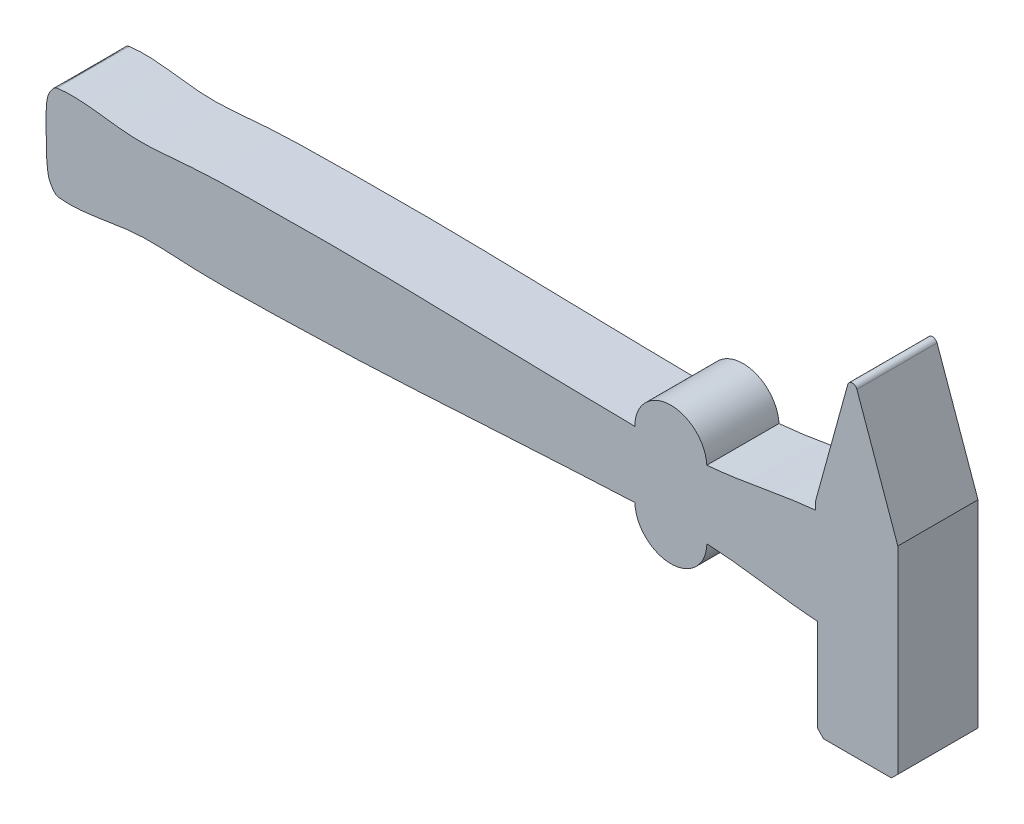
ISO-10303-21;
HEADER;
FILE_DESCRIPTION(('STEP AP214'),'2;1');
FILE_NAME('part.step','',(''),(''),'','','');
FILE_SCHEMA(('AUTOMOTIVE_DESIGN { 1 0 10303 214 1 1 1 1 }'));
ENDSEC;
DATA;
#1=APPLICATION_CONTEXT('core data for automotive mechanical design processes');
#2=APPLICATION_PROTOCOL_DEFINITION('international standard','automotive_design',2000,#1);
#3=PRODUCT_CONTEXT('',#1,'mechanical');
#4=PRODUCT('Part','Part','',(#3));
#5=PRODUCT_RELATED_PRODUCT_CATEGORY('part','',(#4));
#6=PRODUCT_DEFINITION_FORMATION('','',#4);
#7=PRODUCT_DEFINITION_CONTEXT('part definition',#1,'design');
#8=PRODUCT_DEFINITION('design','',#6,#7);
#9=PRODUCT_DEFINITION_SHAPE('','',#8);
#10=(LENGTH_UNIT() NAMED_UNIT(*) SI_UNIT(.MILLI.,.METRE.));
#11=(NAMED_UNIT(*) PLANE_ANGLE_UNIT() SI_UNIT($,.RADIAN.));
#12=(NAMED_UNIT(*) SI_UNIT($,.STERADIAN.) SOLID_ANGLE_UNIT());
#13=UNCERTAINTY_MEASURE_WITH_UNIT(LENGTH_MEASURE(1.E-05),#10,'distance_accuracy_value','');
#14=(GEOMETRIC_REPRESENTATION_CONTEXT(3) GLOBAL_UNCERTAINTY_ASSIGNED_CONTEXT((#13)) GLOBAL_UNIT_ASSIGNED_CONTEXT((#10,
#11,#12)) REPRESENTATION_CONTEXT('',''));
#15=CARTESIAN_POINT('',(0.,0.,0.));
#16=DIRECTION('',(0.,0.,1.));
#17=DIRECTION('',(1.,0.,0.));
#18=AXIS2_PLACEMENT_3D('',#15,#16,#17);
#19=CARTESIAN_POINT('',(-0.68450806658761,78.1907628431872,33.4));
#20=CARTESIAN_POINT('',(-13.6434926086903,76.9835073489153,33.4));
#21=CARTESIAN_POINT('',(-33.3766329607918,72.3930161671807,33.4));
#22=CARTESIAN_POINT('',(-62.7810656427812,70.5584136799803,33.4));
#23=CARTESIAN_POINT('',(-93.440673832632,70.9978990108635,33.4));
#24=CARTESIAN_POINT('',(-138.176641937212,71.9057039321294,33.4));
#25=CARTESIAN_POINT('',(-185.927046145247,73.2892298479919,33.4));
#26=CARTESIAN_POINT('',(-229.529665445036,72.8733691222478,33.4));
#27=CARTESIAN_POINT('',(-259.40709066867,72.4489903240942,33.4));
#28=CARTESIAN_POINT('',(-283.728884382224,69.4231372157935,33.4));
#29=CARTESIAN_POINT('',(-301.923274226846,72.7541457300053,33.4));
#30=CARTESIAN_POINT('',(-312.704353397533,73.0430645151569,33.4));
#31=CARTESIAN_POINT('',(-316.828381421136,72.4242011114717,33.4));
#32=B_SPLINE_CURVE_WITH_KNOTS('',3,(#19,#20,#21,#22,#23,#24,#25,#26,#27,#28,#29,#30,#31),
.UNSPECIFIED.,.F.,.F.,(4,1,1,1,1,1,1,1,1,1,4),(0.,0.123173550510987,0.190951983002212,
0.27844417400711,0.413498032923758,0.614695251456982,0.730775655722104,0.826275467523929,
0.897914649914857,0.961054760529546,1.),.UNSPECIFIED.);
#33=DIRECTION('',(0.,0.,-1.));
#34=VECTOR('',#33,1.);
#35=SURFACE_OF_LINEAR_EXTRUSION('',#32,#34);
#36=CARTESIAN_POINT('',(-316.828381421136,72.4242011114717,3.33));
#37=CARTESIAN_POINT('',(-316.334623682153,72.4983284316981,3.33));
#38=CARTESIAN_POINT('',(-315.839387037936,72.5621855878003,3.33));
#39=CARTESIAN_POINT('',(-314.849201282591,72.670468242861,3.33));
#40=CARTESIAN_POINT('',(-314.354262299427,72.7149859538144,3.33));
#41=CARTESIAN_POINT('',(-313.3647027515,72.7862738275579,3.33));
#42=CARTESIAN_POINT('',(-312.870086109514,72.8130995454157,3.33));
#43=CARTESIAN_POINT('',(-311.881159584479,72.8507289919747,3.33));
#44=CARTESIAN_POINT('',(-311.386850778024,72.8615617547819,3.33));
#45=CARTESIAN_POINT('',(-310.398535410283,72.8689061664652,3.33));
#46=CARTESIAN_POINT('',(-309.904528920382,72.8654291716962,3.33));
#47=CARTESIAN_POINT('',(-308.916809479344,72.8458492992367,3.33));
#48=CARTESIAN_POINT('',(-308.423096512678,72.8297471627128,3.33));
#49=CARTESIAN_POINT('',(-307.436091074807,72.7866145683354,3.33));
#50=CARTESIAN_POINT('',(-306.942798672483,72.7595825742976,3.33));
#51=CARTESIAN_POINT('',(-305.956446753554,72.6962603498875,3.33));
#52=CARTESIAN_POINT('',(-305.463387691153,72.6599631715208,3.33));
#53=CARTESIAN_POINT('',(-304.477458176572,72.579827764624,3.33));
#54=CARTESIAN_POINT('',(-303.984588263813,72.5359829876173,3.33));
#55=CARTESIAN_POINT('',(-302.999019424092,72.4421601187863,3.33));
#56=CARTESIAN_POINT('',(-302.506320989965,72.3921768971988,3.33));
#57=CARTESIAN_POINT('',(-301.521092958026,72.2873499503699,3.33));
#58=CARTESIAN_POINT('',(-301.028563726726,72.232502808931,3.33));
#59=CARTESIAN_POINT('',(-300.043668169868,72.119258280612,3.33));
#60=CARTESIAN_POINT('',(-299.551302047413,72.0608591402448,3.33));
#61=CARTESIAN_POINT('',(-298.262526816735,71.9050344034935,3.33));
#62=CARTESIAN_POINT('',(-297.466338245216,71.805802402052,3.33));
#63=CARTESIAN_POINT('',(-295.874167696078,71.6069783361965,3.33));
#64=CARTESIAN_POINT('',(-295.078185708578,71.50738634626,3.33));
#65=CARTESIAN_POINT('',(-293.48620579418,71.3133647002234,3.33));
#66=CARTESIAN_POINT('',(-292.690208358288,71.2189311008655,3.33));
#67=CARTESIAN_POINT('',(-291.097982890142,71.0407616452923,3.33));
#68=CARTESIAN_POINT('',(-290.301756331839,70.957012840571,3.33));
#69=CARTESIAN_POINT('',(-288.708831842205,70.8057505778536,3.33));
#70=CARTESIAN_POINT('',(-287.912136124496,70.7382145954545,3.33));
#71=CARTESIAN_POINT('',(-286.716383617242,70.6532399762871,3.33));
#72=CARTESIAN_POINT('',(-286.317903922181,70.6276464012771,3.33));
#73=CARTESIAN_POINT('',(-285.520598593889,70.5825683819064,3.33));
#74=CARTESIAN_POINT('',(-285.121772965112,70.5630838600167,3.33));
#75=CARTESIAN_POINT('',(-284.323664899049,70.5309856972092,3.33));
#76=CARTESIAN_POINT('',(-283.924382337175,70.5183751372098,3.33));
#77=CARTESIAN_POINT('',(-283.125665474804,70.499664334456,3.33));
#78=CARTESIAN_POINT('',(-282.726231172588,70.4935641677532,3.33));
#79=CARTESIAN_POINT('',(-281.527241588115,70.4842793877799,3.33));
#80=CARTESIAN_POINT('',(-280.727607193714,70.4901335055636,3.33));
#81=CARTESIAN_POINT('',(-279.127807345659,70.5221191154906,3.33));
#82=CARTESIAN_POINT('',(-278.327642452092,70.548275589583,3.33));
#83=CARTESIAN_POINT('',(-276.726998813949,70.6170648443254,3.33));
#84=CARTESIAN_POINT('',(-275.926521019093,70.6597190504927,3.33));
#85=CARTESIAN_POINT('',(-274.325494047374,70.7577088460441,3.33));
#86=CARTESIAN_POINT('',(-273.524945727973,70.8130580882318,3.33));
#87=CARTESIAN_POINT('',(-272.324378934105,70.9027372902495,3.33));
#88=CARTESIAN_POINT('',(-271.924106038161,70.9337504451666,3.33));
#89=CARTESIAN_POINT('',(-271.12369597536,70.9975208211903,3.33));
#90=CARTESIAN_POINT('',(-270.7235588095,71.0302780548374,3.33));
#91=CARTESIAN_POINT('',(-269.526465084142,71.1301970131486,3.33));
#92=CARTESIAN_POINT('',(-268.729667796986,71.1992494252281,3.33));
#93=CARTESIAN_POINT('',(-267.13618745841,71.3387212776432,3.33));
#94=CARTESIAN_POINT('',(-266.339504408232,71.4091407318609,3.33));
#95=CARTESIAN_POINT('',(-265.144342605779,71.5130361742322,3.33));
#96=CARTESIAN_POINT('',(-264.74593994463,71.5473784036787,3.33));
#97=CARTESIAN_POINT('',(-263.949046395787,71.6150244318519,3.33));
#98=CARTESIAN_POINT('',(-263.55055550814,71.648328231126,3.33));
#99=CARTESIAN_POINT('',(-262.753455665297,71.7134370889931,3.33));
#100=CARTESIAN_POINT('',(-262.354846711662,71.7452421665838,3.33));
#101=CARTESIAN_POINT('',(-261.557476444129,71.8068831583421,3.33));
#102=CARTESIAN_POINT('',(-261.158715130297,71.8367190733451,3.33));
#103=CARTESIAN_POINT('',(-260.361789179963,71.8944333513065,3.33));
#104=CARTESIAN_POINT('',(-259.963624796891,71.9223152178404,3.33));
#105=CARTESIAN_POINT('',(-259.167172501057,71.976256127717,3.33));
#106=CARTESIAN_POINT('',(-258.768884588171,72.0023151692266,3.33));
#107=CARTESIAN_POINT('',(-257.573845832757,72.0778672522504,3.33));
#108=CARTESIAN_POINT('',(-256.776927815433,72.1247346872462,3.33));
#109=CARTESIAN_POINT('',(-255.182692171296,72.2120599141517,3.33));
#110=CARTESIAN_POINT('',(-254.385374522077,72.25251729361,3.33));
#111=CARTESIAN_POINT('',(-252.790470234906,72.3276138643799,3.33));
#112=CARTESIAN_POINT('',(-251.992883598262,72.3622530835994,3.33));
#113=CARTESIAN_POINT('',(-250.398247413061,72.4262832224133,3.33));
#114=CARTESIAN_POINT('',(-249.601198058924,72.4556790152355,3.33));
#115=CARTESIAN_POINT('',(-248.006942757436,72.5098637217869,3.33));
#116=CARTESIAN_POINT('',(-247.209736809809,72.5346526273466,3.33));
#117=CARTESIAN_POINT('',(-244.817993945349,72.60301186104,3.33));
#118=CARTESIAN_POINT('',(-243.223285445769,72.6405765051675,3.33));
#119=CARTESIAN_POINT('',(-240.034190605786,72.7045401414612,3.33));
#120=CARTESIAN_POINT('',(-238.439804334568,72.730942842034,3.33));
#121=CARTESIAN_POINT('',(-235.250936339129,72.7774240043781,3.33));
#122=CARTESIAN_POINT('',(-233.656454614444,72.7975024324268,3.33));
#123=CARTESIAN_POINT('',(-231.26491318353,72.8266205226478,3.33));
#124=CARTESIAN_POINT('',(-230.467858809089,72.8361588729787,3.33));
#125=CARTESIAN_POINT('',(-228.87374789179,72.8549242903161,3.33));
#126=CARTESIAN_POINT('',(-228.076691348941,72.8641513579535,3.33));
#127=CARTESIAN_POINT('',(-225.68551833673,72.8912137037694,3.33));
#128=CARTESIAN_POINT('',(-224.091394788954,72.9084301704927,3.33));
#129=CARTESIAN_POINT('',(-220.903238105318,72.9406092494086,3.33));
#130=CARTESIAN_POINT('',(-219.309204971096,72.9555720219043,3.33));
#131=CARTESIAN_POINT('',(-216.121112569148,72.982619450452,3.33));
#132=CARTESIAN_POINT('',(-214.527053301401,72.994704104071,3.33));
#133=CARTESIAN_POINT('',(-211.337702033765,73.0153832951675,3.33));
#134=CARTESIAN_POINT('',(-209.742410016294,73.0239751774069,3.33));
#135=CARTESIAN_POINT('',(-206.551808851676,73.0370334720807,3.33));
#136=CARTESIAN_POINT('',(-204.95649970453,73.0414998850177,3.33));
#137=CARTESIAN_POINT('',(-201.765512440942,73.0456818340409,3.33));
#138=CARTESIAN_POINT('',(-200.169834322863,73.0453962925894,3.33));
#139=CARTESIAN_POINT('',(-197.776325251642,73.0409431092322,3.33));
#140=CARTESIAN_POINT('',(-196.978490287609,73.0387879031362,3.33));
#141=CARTESIAN_POINT('',(-195.382825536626,73.0330437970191,3.33));
#142=CARTESIAN_POINT('',(-194.584995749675,73.0294548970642,3.33));
#143=CARTESIAN_POINT('',(-192.191161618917,73.0165273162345,3.33));
#144=CARTESIAN_POINT('',(-190.595168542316,73.0050283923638,3.33));
#145=CARTESIAN_POINT('',(-187.403228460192,72.9768434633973,3.33));
#146=CARTESIAN_POINT('',(-185.807281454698,72.9601574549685,3.33));
#147=CARTESIAN_POINT('',(-181.018793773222,72.9030951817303,3.33));
#148=CARTESIAN_POINT('',(-177.826335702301,72.8557190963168,3.33));
#149=CARTESIAN_POINT('',(-171.440984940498,72.7465698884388,3.33));
#150=CARTESIAN_POINT('',(-168.248092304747,72.6847936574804,3.33));
#151=CARTESIAN_POINT('',(-161.861935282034,72.5511084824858,3.33));
#152=CARTESIAN_POINT('',(-158.668670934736,72.4791976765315,3.33));
#153=CARTESIAN_POINT('',(-153.317863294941,72.3537971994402,3.33));
#154=CARTESIAN_POINT('',(-151.160281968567,72.3018966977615,3.33));
#155=CARTESIAN_POINT('',(-146.84515192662,72.1967429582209,3.33));
#156=CARTESIAN_POINT('',(-144.687603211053,72.1434897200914,3.33));
#157=CARTESIAN_POINT('',(-140.372508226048,72.0369523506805,3.33));
#158=CARTESIAN_POINT('',(-138.214961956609,71.9836682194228,3.33));
#159=CARTESIAN_POINT('',(-134.978619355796,71.9046980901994,3.33));
#160=CARTESIAN_POINT('',(-133.899834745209,71.8785340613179,3.33));
#161=CARTESIAN_POINT('',(-131.74225353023,71.82670573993,3.33));
#162=CARTESIAN_POINT('',(-130.663456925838,71.8010414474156,3.33));
#163=CARTESIAN_POINT('',(-127.427543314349,71.7249279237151,3.33));
#164=CARTESIAN_POINT('',(-125.270405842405,71.6753458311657,3.33));
#165=CARTESIAN_POINT('',(-120.956079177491,71.5784632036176,3.33));
#166=CARTESIAN_POINT('',(-118.798889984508,71.5311626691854,3.33));
#167=CARTESIAN_POINT('',(-114.485435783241,71.4388887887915,3.33));
#168=CARTESIAN_POINT('',(-112.329170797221,71.3939144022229,3.33));
#169=CARTESIAN_POINT('',(-108.016594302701,71.3062795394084,3.33));
#170=CARTESIAN_POINT('',(-105.860282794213,71.2636190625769,3.33));
#171=CARTESIAN_POINT('',(-102.626505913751,71.2013881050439,3.33));
#172=CARTESIAN_POINT('',(-101.54905728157,71.1809443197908,3.33));
#173=CARTESIAN_POINT('',(-99.394149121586,71.140639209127,3.33));
#174=CARTESIAN_POINT('',(-98.3166895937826,71.1207778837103,3.33));
#175=CARTESIAN_POINT('',(-96.1617595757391,71.0816401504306,3.33));
#176=CARTESIAN_POINT('',(-95.0842890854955,71.0623637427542,3.33));
#177=CARTESIAN_POINT('',(-92.9293378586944,71.0243941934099,3.33));
#178=CARTESIAN_POINT('',(-91.8518571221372,71.0057010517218,3.33));
#179=CARTESIAN_POINT('',(-90.2361048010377,70.9781171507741,3.33));
#180=CARTESIAN_POINT('',(-89.6978370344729,70.9690024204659,3.33));
#181=CARTESIAN_POINT('',(-88.6212992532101,70.9509067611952,3.33));
#182=CARTESIAN_POINT('',(-88.0830292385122,70.9419258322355,3.33));
#183=CARTESIAN_POINT('',(-86.4682130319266,70.915313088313,3.33));
#184=CARTESIAN_POINT('',(-85.3916612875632,70.8980113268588,3.33));
#185=CARTESIAN_POINT('',(-83.2385172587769,70.8655213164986,3.33));
#186=CARTESIAN_POINT('',(-82.1619249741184,70.8503330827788,3.33));
#187=CARTESIAN_POINT('',(-80.0086997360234,70.8232557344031,3.33));
#188=CARTESIAN_POINT('',(-78.9320667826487,70.8113666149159,3.33));
#189=CARTESIAN_POINT('',(-76.4199242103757,70.7888731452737,3.33));
#190=CARTESIAN_POINT('',(-74.9843976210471,70.7800176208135,3.33));
#191=CARTESIAN_POINT('',(-72.1133216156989,70.7731361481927,3.33));
#192=CARTESIAN_POINT('',(-70.6777721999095,70.7751101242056,3.33));
#193=CARTESIAN_POINT('',(-67.806755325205,70.7927210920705,3.33));
#194=CARTESIAN_POINT('',(-66.3712878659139,70.808358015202,3.33));
#195=CARTESIAN_POINT('',(-63.5023263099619,70.8560931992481,3.33));
#196=CARTESIAN_POINT('',(-62.0688318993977,70.8881718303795,3.33));
#197=CARTESIAN_POINT('',(-59.2023703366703,70.9715799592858,3.33));
#198=CARTESIAN_POINT('',(-57.7694031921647,71.0229097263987,3.33));
#199=CARTESIAN_POINT('',(-54.9043408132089,71.1477166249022,3.33));
#200=CARTESIAN_POINT('',(-53.4722456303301,71.2211949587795,3.33));
#201=CARTESIAN_POINT('',(-50.6094156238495,71.3932232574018,3.33));
#202=CARTESIAN_POINT('',(-49.1786809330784,71.491775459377,3.33));
#203=CARTESIAN_POINT('',(-46.3194607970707,71.7168580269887,3.33));
#204=CARTESIAN_POINT('',(-44.8909752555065,71.8433871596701,3.33));
#205=CARTESIAN_POINT('',(-42.0372723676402,72.1273742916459,3.33));
#206=CARTESIAN_POINT('',(-40.6120545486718,72.2848274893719,3.33));
#207=CARTESIAN_POINT('',(-37.7611297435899,72.6339785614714,3.33));
#208=CARTESIAN_POINT('',(-36.3354362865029,72.825786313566,3.33));
#209=CARTESIAN_POINT('',(-33.4875254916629,73.2345846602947,3.33));
#210=CARTESIAN_POINT('',(-32.0653086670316,73.4515787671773,3.33));
#211=CARTESIAN_POINT('',(-29.2233691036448,73.9022583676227,3.33));
#212=CARTESIAN_POINT('',(-27.803646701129,74.1359459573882,3.33));
#213=CARTESIAN_POINT('',(-24.9609820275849,74.6122742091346,3.33));
#214=CARTESIAN_POINT('',(-23.5380442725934,74.8549414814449,3.33));
#215=CARTESIAN_POINT('',(-20.6923167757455,75.3399643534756,3.33));
#216=CARTESIAN_POINT('',(-19.2695270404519,75.5823199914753,3.33));
#217=CARTESIAN_POINT('',(-16.4227044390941,76.0581986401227,3.33));
#218=CARTESIAN_POINT('',(-14.9986718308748,76.2917231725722,3.33));
#219=CARTESIAN_POINT('',(-12.1471369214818,76.7415449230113,3.33));
#220=CARTESIAN_POINT('',(-10.7196332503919,76.9578335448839,3.33));
#221=CARTESIAN_POINT('',(-7.86056692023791,77.364463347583,3.33));
#222=CARTESIAN_POINT('',(-6.42900351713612,77.5547994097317,3.33));
#223=CARTESIAN_POINT('',(-3.56055293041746,77.9009360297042,3.33));
#224=CARTESIAN_POINT('',(-2.12366234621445,78.0567081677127,3.33));
#225=CARTESIAN_POINT('',(-0.68450806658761,78.1907628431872,3.33));
#226=B_SPLINE_CURVE_WITH_KNOTS('',3,(#36,#37,#38,#39,#40,#41,#42,#43,#44,#45,#46,#47,#48,#49,
#50,#51,#52,#53,#54,#55,#56,#57,#58,#59,#60,#61,#62,#63,#64,#65,#66,#67,#68,#69,#70,#71,#72,#73,
#74,#75,#76,#77,#78,#79,#80,#81,#82,#83,#84,#85,#86,#87,#88,#89,#90,#91,#92,#93,#94,#95,#96,#97,
#98,#99,#100,#101,#102,#103,#104,#105,#106,#107,#108,#109,#110,#111,#112,#113,#114,#115,#116,
#117,#118,#119,#120,#121,#122,#123,#124,#125,#126,#127,#128,#129,#130,#131,#132,#133,#134,#135,
#136,#137,#138,#139,#140,#141,#142,#143,#144,#145,#146,#147,#148,#149,#150,#151,#152,#153,#154,
#155,#156,#157,#158,#159,#160,#161,#162,#163,#164,#165,#166,#167,#168,#169,#170,#171,#172,#173,
#174,#175,#176,#177,#178,#179,#180,#181,#182,#183,#184,#185,#186,#187,#188,#189,#190,#191,#192,
#193,#194,#195,#196,#197,#198,#199,#200,#201,#202,#203,#204,#205,#206,#207,#208,#209,#210,#211,
#212,#213,#214,#215,#216,#217,#218,#219,#220,#221,#222,#223,#224,#225),.UNSPECIFIED.,.F.,.F.,(4,
2,2,2,2,2,2,2,2,2,2,2,2,2,2,2,2,2,2,2,2,2,2,2,2,2,2,2,2,2,2,2,2,2,2,2,2,2,2,2,2,2,2,2,2,2,2,2,2,
2,2,2,2,2,2,2,2,2,2,2,2,2,2,2,2,2,2,2,2,2,2,2,2,2,2,2,2,2,2,2,2,2,2,2,2,2,2,2,2,2,2,2,2,2,4),
(0.,1.49767503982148,2.98812850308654,4.47387918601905,5.95692926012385,7.43880259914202,
8.9205889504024,10.4025836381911,11.8856929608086,13.3700956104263,14.8557472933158,
16.3424508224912,17.8298943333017,20.2369327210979,22.6434987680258,25.0481986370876,
27.4499560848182,29.8483572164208,31.0462212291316,32.2440700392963,33.4424552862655,
34.6408545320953,37.0394762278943,39.4410541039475,41.845761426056,44.2530671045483,
45.457482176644,46.661905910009,49.0612500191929,51.4606185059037,52.6602577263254,
53.8598963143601,55.0595196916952,56.2591425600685,57.4565563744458,58.6539713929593,
61.0488250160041,63.4438326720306,65.8388288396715,68.2315873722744,70.624350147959,
75.4097359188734,80.1935305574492,84.9773507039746,87.3686852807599,89.7600150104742,
94.5426633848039,99.3249714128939,104.10728348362,108.893224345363,113.679164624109,
118.46619016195,120.859702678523,123.253215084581,128.041308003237,132.829403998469,
142.407783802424,151.988233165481,161.570444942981,168.045060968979,174.519678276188,
180.994290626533,184.231596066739,187.468901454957,193.942021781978,200.415143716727,
206.885344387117,213.355543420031,216.588470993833,219.821398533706,223.0543271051,
226.287255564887,227.902290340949,229.517325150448,232.747396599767,235.977491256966,
239.207581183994,243.514212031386,247.820812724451,252.127391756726,256.428841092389,
260.730350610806,265.032093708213,269.334220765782,273.636158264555,277.937428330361,
282.252709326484,286.568592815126,290.885019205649,295.215463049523,299.54531124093,
303.874409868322,308.205654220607,312.537751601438,316.87339791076),.UNSPECIFIED.);
#227=CARTESIAN_POINT('',(-46.0334696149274,71.7462347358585,3.33));
#228=VERTEX_POINT('',#227);
#229=CARTESIAN_POINT('',(-0.68450806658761,78.1907628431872,3.33));
#230=VERTEX_POINT('',#229);
#231=EDGE_CURVE('E183',#228,#230,#226,.T.);
#232=ORIENTED_EDGE('',*,*,#231,.F.);
#233=DIRECTION('',(0.,0.,1.));
#234=VECTOR('',#233,1.);
#235=CARTESIAN_POINT('',(-46.033469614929,71.7462347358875,-30.2644349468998));
#236=LINE('',#235,#234);
#237=CARTESIAN_POINT('',(-46.033469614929,71.7462347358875,33.4));
#238=VERTEX_POINT('',#237);
#239=EDGE_CURVE('E54',#228,#238,#236,.T.);
#240=ORIENTED_EDGE('',*,*,#239,.T.);
#241=CARTESIAN_POINT('',(-0.68450806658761,78.1907628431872,33.4));
#242=VERTEX_POINT('',#241);
#243=EDGE_CURVE('E301',#242,#238,#32,.T.);
#244=ORIENTED_EDGE('',*,*,#243,.F.);
#245=DIRECTION('',(0.,0.,-1.));
#246=VECTOR('',#245,1.);
#247=CARTESIAN_POINT('',(-0.68450806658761,78.1907628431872,33.4));
#248=LINE('',#247,#246);
#249=EDGE_CURVE('E312',#242,#230,#248,.T.);
#250=ORIENTED_EDGE('',*,*,#249,.T.);
#251=EDGE_LOOP('',(#232,#240,#244,#250));
#252=FACE_BOUND('',#251,.T.);
#253=ADVANCED_FACE('F37',(#252),#35,.F.);
#254=CARTESIAN_POINT('',(-316.154687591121,33.3659187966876,33.4));
#255=CARTESIAN_POINT('',(-312.01177021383,32.8896471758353,33.4));
#256=CARTESIAN_POINT('',(-301.247067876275,33.5501967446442,33.4));
#257=CARTESIAN_POINT('',(-283.178375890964,37.5066862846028,33.4));
#258=CARTESIAN_POINT('',(-258.766698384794,35.3214087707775,33.4));
#259=CARTESIAN_POINT('',(-228.892410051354,35.9276528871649,33.4));
#260=CARTESIAN_POINT('',(-185.301385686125,37.0157451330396,33.4));
#261=CARTESIAN_POINT('',(-137.627098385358,40.0451966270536,33.4));
#262=CARTESIAN_POINT('',(-92.9490480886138,42.4952524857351,33.4));
#263=CARTESIAN_POINT('',(-62.3228337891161,43.9918216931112,33.4));
#264=CARTESIAN_POINT('',(-32.872622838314,43.1723690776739,33.4));
#265=CARTESIAN_POINT('',(-12.9929101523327,39.2651371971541,33.4));
#266=CARTESIAN_POINT('',(0.,38.505510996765,33.4));
#267=B_SPLINE_CURVE_WITH_KNOTS('',3,(#254,#255,#256,#257,#258,#259,#260,#261,#262,#263,#264,
#265,#266),.UNSPECIFIED.,.F.,.F.,(4,1,1,1,1,1,1,1,1,1,4),(0.,0.038945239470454,
0.102085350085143,0.173724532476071,0.269224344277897,0.385304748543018,0.586501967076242,
0.72155582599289,0.809048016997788,0.876826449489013,1.),.UNSPECIFIED.);
#268=DIRECTION('',(0.,0.,-1.));
#269=VECTOR('',#268,1.);
#270=SURFACE_OF_LINEAR_EXTRUSION('',#267,#269);
#271=CARTESIAN_POINT('',(0.,38.505510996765,3.33));
#272=CARTESIAN_POINT('',(-0.974336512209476,38.5624701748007,3.33));
#273=CARTESIAN_POINT('',(-1.94803946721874,38.6293596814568,3.33));
#274=CARTESIAN_POINT('',(-3.89379100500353,38.7802965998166,3.33));
#275=CARTESIAN_POINT('',(-4.8658400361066,38.8643381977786,3.33));
#276=CARTESIAN_POINT('',(-6.80847275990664,39.0469109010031,3.33));
#277=CARTESIAN_POINT('',(-7.7790565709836,39.1454407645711,3.33));
#278=CARTESIAN_POINT('',(-9.71704466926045,39.3541095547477,3.33));
#279=CARTESIAN_POINT('',(-10.684451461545,39.4642253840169,3.33));
#280=CARTESIAN_POINT('',(-12.6182469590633,39.6935755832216,3.33));
#281=CARTESIAN_POINT('',(-13.5846355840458,39.8128106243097,3.33));
#282=CARTESIAN_POINT('',(-15.5166122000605,40.0577482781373,3.33));
#283=CARTESIAN_POINT('',(-16.4822001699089,40.1834510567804,3.33));
#284=CARTESIAN_POINT('',(-18.4111822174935,40.4384624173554,3.33));
#285=CARTESIAN_POINT('',(-19.3745771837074,40.5677643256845,3.33));
#286=CARTESIAN_POINT('',(-21.3011764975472,40.827564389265,3.33));
#287=CARTESIAN_POINT('',(-22.2643808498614,40.9580625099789,3.33));
#288=CARTESIAN_POINT('',(-24.1909907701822,41.2176473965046,3.33));
#289=CARTESIAN_POINT('',(-25.1543963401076,41.3467341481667,3.33));
#290=CARTESIAN_POINT('',(-27.0795906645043,41.6005954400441,3.33));
#291=CARTESIAN_POINT('',(-28.0413782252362,41.7253789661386,3.33));
#292=CARTESIAN_POINT('',(-29.9657895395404,41.9683280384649,3.33));
#293=CARTESIAN_POINT('',(-30.9284132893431,42.0864936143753,3.33));
#294=CARTESIAN_POINT('',(-32.8547512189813,42.3135900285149,3.33));
#295=CARTESIAN_POINT('',(-33.8184653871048,42.422520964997,3.33));
#296=CARTESIAN_POINT('',(-35.2640881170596,42.5769204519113,3.33));
#297=CARTESIAN_POINT('',(-35.7455217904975,42.6268450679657,3.33));
#298=CARTESIAN_POINT('',(-36.708718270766,42.7234164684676,3.33));
#299=CARTESIAN_POINT('',(-37.1904810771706,42.7700632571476,3.33));
#300=CARTESIAN_POINT('',(-38.1543475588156,42.8597291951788,3.33));
#301=CARTESIAN_POINT('',(-38.636451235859,42.9027483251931,3.33));
#302=CARTESIAN_POINT('',(-39.6009881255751,42.984921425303,3.33));
#303=CARTESIAN_POINT('',(-40.0834213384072,43.0240753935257,3.33));
#304=CARTESIAN_POINT('',(-41.0485705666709,43.0986724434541,3.33));
#305=CARTESIAN_POINT('',(-41.5312865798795,43.1341155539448,3.33));
#306=CARTESIAN_POINT('',(-42.496969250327,43.2013931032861,3.33));
#307=CARTESIAN_POINT('',(-42.9799359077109,43.2332275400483,3.33));
#308=CARTESIAN_POINT('',(-44.4290065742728,43.3234822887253,3.33));
#309=CARTESIAN_POINT('',(-45.395440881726,43.3766662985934,3.33));
#310=CARTESIAN_POINT('',(-47.3289534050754,43.4699747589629,3.33));
#311=CARTESIAN_POINT('',(-48.2960316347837,43.5100989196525,3.33));
#312=CARTESIAN_POINT('',(-50.2306169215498,43.5781948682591,3.33));
#313=CARTESIAN_POINT('',(-51.1981239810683,43.6061665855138,3.33));
#314=CARTESIAN_POINT('',(-53.6158445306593,43.6620044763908,3.33));
#315=CARTESIAN_POINT('',(-55.0662217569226,43.6828648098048,3.33));
#316=CARTESIAN_POINT('',(-57.9670879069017,43.7023595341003,3.33));
#317=CARTESIAN_POINT('',(-59.4175768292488,43.700994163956,3.33));
#318=CARTESIAN_POINT('',(-62.3189437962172,43.6790265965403,3.33));
#319=CARTESIAN_POINT('',(-63.769821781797,43.6584171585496,3.33));
#320=CARTESIAN_POINT('',(-66.6712475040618,43.6008559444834,3.33));
#321=CARTESIAN_POINT('',(-68.1217952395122,43.5639041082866,3.33));
#322=CARTESIAN_POINT('',(-71.0234873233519,43.4765552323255,3.33));
#323=CARTESIAN_POINT('',(-72.4746313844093,43.426148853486,3.33));
#324=CARTESIAN_POINT('',(-75.3765076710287,43.3148369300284,3.33));
#325=CARTESIAN_POINT('',(-76.8272398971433,43.2539313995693,3.33));
#326=CARTESIAN_POINT('',(-79.7291945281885,43.1245154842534,3.33));
#327=CARTESIAN_POINT('',(-81.1804167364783,43.0560007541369,3.33));
#328=CARTESIAN_POINT('',(-83.3570783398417,42.9497537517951,3.33));
#329=CARTESIAN_POINT('',(-84.08260389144,42.913758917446,3.33));
#330=CARTESIAN_POINT('',(-85.5336148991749,42.8409681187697,3.33));
#331=CARTESIAN_POINT('',(-86.259100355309,42.8041721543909,3.33));
#332=CARTESIAN_POINT('',(-87.710206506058,42.7301767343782,3.33));
#333=CARTESIAN_POINT('',(-88.4358271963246,42.6929771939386,3.33));
#334=CARTESIAN_POINT('',(-89.8870561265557,42.6183369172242,3.33));
#335=CARTESIAN_POINT('',(-90.6126643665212,42.580896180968,3.33));
#336=CARTESIAN_POINT('',(-92.789466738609,42.4681672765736,3.33));
#337=CARTESIAN_POINT('',(-94.2406398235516,42.3924723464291,3.33));
#338=CARTESIAN_POINT('',(-97.1427416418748,42.2400354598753,3.33));
#339=CARTESIAN_POINT('',(-98.5936703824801,42.1632936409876,3.33));
#340=CARTESIAN_POINT('',(-101.495471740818,42.0087509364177,3.33));
#341=CARTESIAN_POINT('',(-102.946344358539,41.9309500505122,3.33));
#342=CARTESIAN_POINT('',(-107.336507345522,41.6939349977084,3.33));
#343=CARTESIAN_POINT('',(-110.275709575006,41.5330849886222,3.33));
#344=CARTESIAN_POINT('',(-116.152807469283,41.2071538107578,3.33));
#345=CARTESIAN_POINT('',(-119.090703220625,41.0420742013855,3.33));
#346=CARTESIAN_POINT('',(-124.965515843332,40.7076903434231,3.33));
#347=CARTESIAN_POINT('',(-127.9024327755,40.5383871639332,3.33));
#348=CARTESIAN_POINT('',(-133.775616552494,40.1956195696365,3.33));
#349=CARTESIAN_POINT('',(-136.711883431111,40.0221557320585,3.33));
#350=CARTESIAN_POINT('',(-142.584287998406,39.6744253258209,3.33));
#351=CARTESIAN_POINT('',(-145.520425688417,39.5001587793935,3.33));
#352=CARTESIAN_POINT('',(-151.393090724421,39.1541247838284,3.33));
#353=CARTESIAN_POINT('',(-154.329618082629,38.9823575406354,3.33));
#354=CARTESIAN_POINT('',(-160.205871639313,38.6445090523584,3.33));
#355=CARTESIAN_POINT('',(-163.145598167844,38.4784335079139,3.33));
#356=CARTESIAN_POINT('',(-169.025841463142,38.155473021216,3.33));
#357=CARTESIAN_POINT('',(-171.966358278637,37.9985889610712,3.33));
#358=CARTESIAN_POINT('',(-177.848118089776,37.6973717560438,3.33));
#359=CARTESIAN_POINT('',(-180.789361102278,37.5530389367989,3.33));
#360=CARTESIAN_POINT('',(-185.201736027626,37.3484722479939,3.33));
#361=CARTESIAN_POINT('',(-186.672592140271,37.2822729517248,3.33));
#362=CARTESIAN_POINT('',(-189.614495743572,37.1542662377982,3.33));
#363=CARTESIAN_POINT('',(-191.08554323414,37.0924588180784,3.33));
#364=CARTESIAN_POINT('',(-193.292210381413,37.003367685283,3.33));
#365=CARTESIAN_POINT('',(-194.02775731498,36.9742748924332,3.33));
#366=CARTESIAN_POINT('',(-195.49889917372,36.9173289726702,3.33));
#367=CARTESIAN_POINT('',(-196.234494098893,36.8894758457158,3.33));
#368=CARTESIAN_POINT('',(-198.441343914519,36.8076698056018,3.33));
#369=CARTESIAN_POINT('',(-199.912663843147,36.7554702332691,3.33));
#370=CARTESIAN_POINT('',(-204.326506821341,36.6051722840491,3.33));
#371=CARTESIAN_POINT('',(-207.269244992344,36.5133614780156,3.33));
#372=CARTESIAN_POINT('',(-211.1935130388,36.3995035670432,3.33));
#373=CARTESIAN_POINT('',(-212.174883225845,36.371745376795,3.33));
#374=CARTESIAN_POINT('',(-214.137659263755,36.3175132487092,3.33));
#375=CARTESIAN_POINT('',(-215.119065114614,36.2910393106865,3.33));
#376=CARTESIAN_POINT('',(-217.081906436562,36.2392307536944,3.33));
#377=CARTESIAN_POINT('',(-218.063341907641,36.2138961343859,3.33));
#378=CARTESIAN_POINT('',(-220.026285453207,36.1642197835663,3.33));
#379=CARTESIAN_POINT('',(-221.007793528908,36.139878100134,3.33));
#380=CARTESIAN_POINT('',(-222.970830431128,36.0920450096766,3.33));
#381=CARTESIAN_POINT('',(-223.952359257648,36.0685536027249,3.33));
#382=CARTESIAN_POINT('',(-225.915433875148,36.0222720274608,3.33));
#383=CARTESIAN_POINT('',(-226.896979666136,35.9994818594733,3.33));
#384=CARTESIAN_POINT('',(-228.860103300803,35.9544723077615,3.33));
#385=CARTESIAN_POINT('',(-229.841681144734,35.9322529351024,3.33));
#386=CARTESIAN_POINT('',(-231.804845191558,35.8881842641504,3.33));
#387=CARTESIAN_POINT('',(-232.786431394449,35.8663349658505,3.33));
#388=CARTESIAN_POINT('',(-234.749636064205,35.8240675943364,3.33));
#389=CARTESIAN_POINT('',(-235.731254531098,35.8036495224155,3.33));
#390=CARTESIAN_POINT('',(-237.694475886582,35.7654000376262,3.33));
#391=CARTESIAN_POINT('',(-238.676078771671,35.7475684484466,3.33));
#392=CARTESIAN_POINT('',(-240.639345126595,35.7156194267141,3.33));
#393=CARTESIAN_POINT('',(-241.621008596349,35.7015019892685,3.33));
#394=CARTESIAN_POINT('',(-243.584400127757,35.6781160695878,3.33));
#395=CARTESIAN_POINT('',(-244.566128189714,35.6688476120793,3.33));
#396=CARTESIAN_POINT('',(-246.52965422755,35.6562908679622,3.33));
#397=CARTESIAN_POINT('',(-247.51145220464,35.6530027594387,3.33));
#398=CARTESIAN_POINT('',(-249.475049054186,35.6535357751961,3.33));
#399=CARTESIAN_POINT('',(-250.456847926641,35.6573569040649,3.33));
#400=CARTESIAN_POINT('',(-252.420385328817,35.6732318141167,3.33));
#401=CARTESIAN_POINT('',(-253.402123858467,35.6852856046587,3.33));
#402=CARTESIAN_POINT('',(-254.874962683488,35.7103829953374,3.33));
#403=CARTESIAN_POINT('',(-255.36612411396,35.7199229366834,3.33));
#404=CARTESIAN_POINT('',(-256.348393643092,35.7414819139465,3.33));
#405=CARTESIAN_POINT('',(-256.839501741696,35.7535009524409,3.33));
#406=CARTESIAN_POINT('',(-257.821641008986,35.780155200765,3.33));
#407=CARTESIAN_POINT('',(-258.312672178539,35.7947903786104,3.33));
#408=CARTESIAN_POINT('',(-259.294643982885,35.8268167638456,3.33));
#409=CARTESIAN_POINT('',(-259.785584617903,35.8442079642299,3.33));
#410=CARTESIAN_POINT('',(-260.52189914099,35.8724555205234,3.33));
#411=CARTESIAN_POINT('',(-260.767314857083,35.8822312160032,3.33));
#412=CARTESIAN_POINT('',(-261.258115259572,35.9025329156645,3.33));
#413=CARTESIAN_POINT('',(-261.503499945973,35.9130589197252,3.33));
#414=CARTESIAN_POINT('',(-262.239608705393,35.9456686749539,3.33));
#415=CARTESIAN_POINT('',(-262.730287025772,35.96878415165,3.33));
#416=CARTESIAN_POINT('',(-263.713059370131,36.0169516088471,3.33));
#417=CARTESIAN_POINT('',(-264.205153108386,36.0420093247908,3.33));
#418=CARTESIAN_POINT('',(-265.18928726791,36.0931426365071,3.33));
#419=CARTESIAN_POINT('',(-265.681327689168,36.1192182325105,3.33));
#420=CARTESIAN_POINT('',(-267.15748674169,36.1976788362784,3.33));
#421=CARTESIAN_POINT('',(-268.141593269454,36.2502950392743,3.33));
#422=CARTESIAN_POINT('',(-270.11036152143,36.3492534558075,3.33));
#423=CARTESIAN_POINT('',(-271.095023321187,36.3955942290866,3.33));
#424=CARTESIAN_POINT('',(-273.06221566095,36.4749109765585,3.33));
#425=CARTESIAN_POINT('',(-274.044744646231,36.5079232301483,3.33));
#426=CARTESIAN_POINT('',(-276.010158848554,36.5537485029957,3.33));
#427=CARTESIAN_POINT('',(-276.993043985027,36.5665647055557,3.33));
#428=CARTESIAN_POINT('',(-278.958512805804,36.5649014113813,3.33));
#429=CARTESIAN_POINT('',(-279.941096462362,36.5504323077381,3.33));
#430=CARTESIAN_POINT('',(-281.413993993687,36.502916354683,3.33));
#431=CARTESIAN_POINT('',(-281.904734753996,36.4827798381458,3.33));
#432=CARTESIAN_POINT('',(-282.885736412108,36.4330515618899,3.33));
#433=CARTESIAN_POINT('',(-283.37599732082,36.4034600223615,3.33));
#434=CARTESIAN_POINT('',(-284.355876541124,36.333841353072,3.33));
#435=CARTESIAN_POINT('',(-284.845494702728,36.2938121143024,3.33));
#436=CARTESIAN_POINT('',(-285.823885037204,36.2044872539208,3.33));
#437=CARTESIAN_POINT('',(-286.312657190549,36.1551914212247,3.33));
#438=CARTESIAN_POINT('',(-287.777661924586,35.9954307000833,3.33));
#439=CARTESIAN_POINT('',(-288.752597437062,35.873091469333,3.33));
#440=CARTESIAN_POINT('',(-290.703628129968,35.6065660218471,3.33));
#441=CARTESIAN_POINT('',(-291.679710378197,35.4622884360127,3.33));
#442=CARTESIAN_POINT('',(-293.630147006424,35.1625892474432,3.33));
#443=CARTESIAN_POINT('',(-294.604501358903,35.0071674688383,3.33));
#444=CARTESIAN_POINT('',(-296.553535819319,34.6952489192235,3.33));
#445=CARTESIAN_POINT('',(-297.528215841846,34.5387516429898,3.33));
#446=CARTESIAN_POINT('',(-299.477538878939,34.2351054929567,3.33));
#447=CARTESIAN_POINT('',(-300.452179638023,34.0879425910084,3.33));
#448=CARTESIAN_POINT('',(-301.915985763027,33.8816898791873,3.33));
#449=CARTESIAN_POINT('',(-302.404124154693,33.815366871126,3.33));
#450=CARTESIAN_POINT('',(-303.381193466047,33.6887956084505,3.33));
#451=CARTESIAN_POINT('',(-303.870124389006,33.6285473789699,3.33));
#452=CARTESIAN_POINT('',(-304.848286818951,33.5156158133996,3.33));
#453=CARTESIAN_POINT('',(-305.337517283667,33.4629236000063,3.33));
#454=CARTESIAN_POINT('',(-306.316864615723,33.3667374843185,3.33));
#455=CARTESIAN_POINT('',(-306.80698147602,33.3232435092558,3.33));
#456=CARTESIAN_POINT('',(-308.277602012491,33.2091668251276,3.33));
#457=CARTESIAN_POINT('',(-309.259519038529,33.1548494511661,3.33));
#458=CARTESIAN_POINT('',(-310.734136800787,33.1159362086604,3.33));
#459=CARTESIAN_POINT('',(-311.226311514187,33.1100697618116,3.33));
#460=CARTESIAN_POINT('',(-312.210582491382,33.1141627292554,3.33));
#461=CARTESIAN_POINT('',(-312.7026787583,33.1241209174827,3.33));
#462=CARTESIAN_POINT('',(-313.688918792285,33.1614917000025,3.33));
#463=CARTESIAN_POINT('',(-314.183059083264,33.1889992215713,3.33));
#464=CARTESIAN_POINT('',(-315.170063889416,33.2629278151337,3.33));
#465=CARTESIAN_POINT('',(-315.662927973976,33.3093545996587,3.33));
#466=CARTESIAN_POINT('',(-316.154687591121,33.3659187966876,3.33));
#467=B_SPLINE_CURVE_WITH_KNOTS('',3,(#271,#272,#273,#274,#275,#276,#277,#278,#279,#280,#281,
#282,#283,#284,#285,#286,#287,#288,#289,#290,#291,#292,#293,#294,#295,#296,#297,#298,#299,#300,
#301,#302,#303,#304,#305,#306,#307,#308,#309,#310,#311,#312,#313,#314,#315,#316,#317,#318,#319,
#320,#321,#322,#323,#324,#325,#326,#327,#328,#329,#330,#331,#332,#333,#334,#335,#336,#337,#338,
#339,#340,#341,#342,#343,#344,#345,#346,#347,#348,#349,#350,#351,#352,#353,#354,#355,#356,#357,
#358,#359,#360,#361,#362,#363,#364,#365,#366,#367,#368,#369,#370,#371,#372,#373,#374,#375,#376,
#377,#378,#379,#380,#381,#382,#383,#384,#385,#386,#387,#388,#389,#390,#391,#392,#393,#394,#395,
#396,#397,#398,#399,#400,#401,#402,#403,#404,#405,#406,#407,#408,#409,#410,#411,#412,#413,#414,
#415,#416,#417,#418,#419,#420,#421,#422,#423,#424,#425,#426,#427,#428,#429,#430,#431,#432,#433,
#434,#435,#436,#437,#438,#439,#440,#441,#442,#443,#444,#445,#446,#447,#448,#449,#450,#451,#452,
#453,#454,#455,#456,#457,#458,#459,#460,#461,#462,#463,#464,#465,#466),.UNSPECIFIED.,.F.,.F.,(4,
2,2,2,2,2,2,2,2,2,2,2,2,2,2,2,2,2,2,2,2,2,2,2,2,2,2,2,2,2,2,2,2,2,2,2,2,2,2,2,2,2,2,2,2,2,2,2,2,
2,2,2,2,2,2,2,2,2,2,2,2,2,2,2,2,2,2,2,2,2,2,2,2,2,2,2,2,2,2,2,2,2,2,2,2,2,2,2,2,2,2,2,2,2,2,2,2,
4),(0.,2.92787295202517,5.85475513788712,8.7813866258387,11.7022904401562,14.6234094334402,
17.5446033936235,20.4607008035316,23.3767142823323,26.29275696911,29.2022878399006,
32.1118056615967,35.0212925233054,36.4733292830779,37.9253641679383,39.3774067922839,
40.829450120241,42.2814821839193,43.7335150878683,46.6371007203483,49.5407507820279,
52.444417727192,56.7957899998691,61.1471154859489,65.5000788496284,69.8530582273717,
74.2090669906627,78.5650698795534,82.9235731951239,85.1028266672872,87.2820802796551,
89.4618010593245,91.6415216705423,96.0009589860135,100.359829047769,104.718700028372,
113.54949731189,122.377084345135,131.20245910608,140.026616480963,148.850530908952,
157.675168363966,166.508400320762,175.342478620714,184.176786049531,188.593816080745,
193.010844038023,195.219209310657,197.427574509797,201.844304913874,210.676769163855,
213.622057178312,216.567344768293,219.512631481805,222.458060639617,225.403490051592,
228.348920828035,231.294408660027,234.239896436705,237.185386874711,240.130676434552,
243.07596211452,246.021262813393,248.966651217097,251.912041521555,254.857435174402,
256.331192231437,257.804950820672,259.278691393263,260.752428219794,261.489258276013,
262.226088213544,263.699749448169,265.17794158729,266.656134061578,269.612668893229,
272.569881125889,275.518988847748,278.467631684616,281.415151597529,282.888538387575,
284.361890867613,285.83554127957,287.309225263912,290.256549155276,293.216502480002,
296.176502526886,299.138003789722,302.094943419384,303.572781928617,305.050626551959,
306.526720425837,308.002802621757,310.951513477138,312.427937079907,313.90424629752,
315.38860961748,316.873421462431),.UNSPECIFIED.);
#468=CARTESIAN_POINT('',(-76.0052739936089,43.2872771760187,3.33));
#469=VERTEX_POINT('',#468);
#470=CARTESIAN_POINT('',(-316.154687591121,33.3659187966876,3.33));
#471=VERTEX_POINT('',#470);
#472=EDGE_CURVE('E186',#469,#471,#467,.T.);
#473=ORIENTED_EDGE('',*,*,#472,.F.);
#474=DIRECTION('',(0.,0.,1.));
#475=VECTOR('',#474,1.);
#476=CARTESIAN_POINT('',(-76.0052739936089,43.2872771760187,-30.2644349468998));
#477=LINE('',#476,#475);
#478=CARTESIAN_POINT('',(-76.0052739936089,43.2872771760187,33.4));
#479=VERTEX_POINT('',#478);
#480=EDGE_CURVE('E62',#469,#479,#477,.T.);
#481=ORIENTED_EDGE('',*,*,#480,.T.);
#482=CARTESIAN_POINT('',(-316.154687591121,33.3659187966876,33.4));
#483=VERTEX_POINT('',#482);
#484=EDGE_CURVE('E322',#483,#479,#267,.T.);
#485=ORIENTED_EDGE('',*,*,#484,.F.);
#486=DIRECTION('',(0.,0.,-1.));
#487=VECTOR('',#486,1.);
#488=CARTESIAN_POINT('',(-316.154687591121,33.3659187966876,33.4));
#489=LINE('',#488,#487);
#490=EDGE_CURVE('E386',#483,#471,#489,.T.);
#491=ORIENTED_EDGE('',*,*,#490,.T.);
#492=EDGE_LOOP('',(#473,#481,#485,#491));
#493=FACE_BOUND('',#492,.T.);
#494=ADVANCED_FACE('F346',(#493),#270,.F.);
#495=CARTESIAN_POINT('',(-76.0100738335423,70.7875172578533,33.4));
#496=VERTEX_POINT('',#495);
#497=CARTESIAN_POINT('',(-316.828381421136,72.4242011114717,33.4));
#498=VERTEX_POINT('',#497);
#499=EDGE_CURVE('E177',#496,#498,#32,.T.);
#500=ORIENTED_EDGE('',*,*,#499,.F.);
#501=DIRECTION('',(0.,0.,1.));
#502=VECTOR('',#501,1.);
#503=CARTESIAN_POINT('',(-76.0100738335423,70.7875172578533,-30.2644349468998));
#504=LINE('',#503,#502);
#505=CARTESIAN_POINT('',(-76.0100738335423,70.7875172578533,3.33));
#506=VERTEX_POINT('',#505);
#507=EDGE_CURVE('E163',#506,#496,#504,.T.);
#508=ORIENTED_EDGE('',*,*,#507,.F.);
#509=CARTESIAN_POINT('',(-316.828381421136,72.4242011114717,3.33));
#510=VERTEX_POINT('',#509);
#511=EDGE_CURVE('E175',#510,#506,#226,.T.);
#512=ORIENTED_EDGE('',*,*,#511,.F.);
#513=DIRECTION('',(0.,0.,-1.));
#514=VECTOR('',#513,1.);
#515=CARTESIAN_POINT('',(-316.828381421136,72.4242011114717,33.4));
#516=LINE('',#515,#514);
#517=EDGE_CURVE('E310',#498,#510,#516,.T.);
#518=ORIENTED_EDGE('',*,*,#517,.F.);
#519=EDGE_LOOP('',(#500,#508,#512,#518));
#520=FACE_BOUND('',#519,.T.);
#521=ADVANCED_FACE('F173',(#520),#35,.F.);
#522=CARTESIAN_POINT('',(-316.828381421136,72.4242011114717,33.4));
#523=CARTESIAN_POINT('',(-317.577160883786,72.3118371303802,33.4));
#524=CARTESIAN_POINT('',(-318.841511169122,71.029543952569,33.4));
#525=CARTESIAN_POINT('',(-320.809336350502,67.9434531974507,33.4));
#526=CARTESIAN_POINT('',(-321.463284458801,61.4325346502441,33.4));
#527=CARTESIAN_POINT('',(-321.320797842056,56.2054246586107,33.4));
#528=CARTESIAN_POINT('',(-321.218635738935,52.8135249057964,33.4));
#529=B_SPLINE_CURVE_WITH_KNOTS('',3,(#522,#523,#524,#525,#526,#527,#528),.UNSPECIFIED.,.F.,.F.,
(4,1,1,1,4),(0.,0.100752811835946,0.240872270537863,0.52065498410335,1.),.UNSPECIFIED.);
#530=DIRECTION('',(0.,0.,-1.));
#531=VECTOR('',#530,1.);
#532=SURFACE_OF_LINEAR_EXTRUSION('',#529,#531);
#533=CARTESIAN_POINT('',(-321.218635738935,52.8135249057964,3.33));
#534=CARTESIAN_POINT('',(-321.228080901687,53.1271658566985,3.33));
#535=CARTESIAN_POINT('',(-321.237448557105,53.4408099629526,3.33));
#536=CARTESIAN_POINT('',(-321.255587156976,54.0681465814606,3.33));
#537=CARTESIAN_POINT('',(-321.264358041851,54.3818390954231,3.33));
#538=CARTESIAN_POINT('',(-321.280859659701,55.0092640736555,3.33));
#539=CARTESIAN_POINT('',(-321.288590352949,55.3229965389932,3.33));
#540=CARTESIAN_POINT('',(-321.30253258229,55.9491780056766,3.33));
#541=CARTESIAN_POINT('',(-321.308750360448,56.2616268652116,3.33));
#542=CARTESIAN_POINT('',(-321.319265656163,56.886547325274,3.33));
#543=CARTESIAN_POINT('',(-321.323563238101,57.1990189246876,3.33));
#544=CARTESIAN_POINT('',(-321.329800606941,57.8239767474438,3.33));
#545=CARTESIAN_POINT('',(-321.331740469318,58.136462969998,3.33));
#546=CARTESIAN_POINT('',(-321.332834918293,58.7615000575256,3.33));
#547=CARTESIAN_POINT('',(-321.331988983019,59.0740509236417,3.33));
#548=CARTESIAN_POINT('',(-321.327098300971,59.6991373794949,3.33));
#549=CARTESIAN_POINT('',(-321.32305346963,60.0116729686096,3.33));
#550=CARTESIAN_POINT('',(-321.311369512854,60.6367020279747,3.33));
#551=CARTESIAN_POINT('',(-321.303730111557,60.9491954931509,3.33));
#552=CARTESIAN_POINT('',(-321.284445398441,61.575727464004,3.33));
#553=CARTESIAN_POINT('',(-321.272778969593,61.8897653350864,3.33));
#554=CARTESIAN_POINT('',(-321.252001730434,62.3606724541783,3.33));
#555=CARTESIAN_POINT('',(-321.244529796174,62.5176152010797,3.33));
#556=CARTESIAN_POINT('',(-321.228492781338,62.8314453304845,3.33));
#557=CARTESIAN_POINT('',(-321.219927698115,62.9883327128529,3.33));
#558=CARTESIAN_POINT('',(-321.201457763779,63.3020263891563,3.33));
#559=CARTESIAN_POINT('',(-321.191552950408,63.4588326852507,3.33));
#560=CARTESIAN_POINT('',(-321.169891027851,63.7723158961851,3.33));
#561=CARTESIAN_POINT('',(-321.15813391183,63.9289928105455,3.33));
#562=CARTESIAN_POINT('',(-321.11440040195,64.4593352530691,3.33));
#563=CARTESIAN_POINT('',(-321.076995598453,64.832593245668,3.33));
#564=CARTESIAN_POINT('',(-320.982279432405,65.5768107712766,3.33));
#565=CARTESIAN_POINT('',(-320.924962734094,65.9477696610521,3.33));
#566=CARTESIAN_POINT('',(-320.783830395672,66.6812207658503,3.33));
#567=CARTESIAN_POINT('',(-320.700264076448,67.0437595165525,3.33));
#568=CARTESIAN_POINT('',(-320.499183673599,67.7592512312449,3.33));
#569=CARTESIAN_POINT('',(-320.381711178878,68.112215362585,3.33));
#570=CARTESIAN_POINT('',(-320.193721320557,68.5829772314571,3.33));
#571=CARTESIAN_POINT('',(-320.1407129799,68.7078698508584,3.33));
#572=CARTESIAN_POINT('',(-320.029175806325,68.9551862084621,3.33));
#573=CARTESIAN_POINT('',(-319.970646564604,69.0776097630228,3.33));
#574=CARTESIAN_POINT('',(-319.848389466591,69.3198380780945,3.33));
#575=CARTESIAN_POINT('',(-319.784661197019,69.4396426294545,3.33));
#576=CARTESIAN_POINT('',(-319.651998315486,69.6770199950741,3.33));
#577=CARTESIAN_POINT('',(-319.583042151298,69.7945807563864,3.33));
#578=CARTESIAN_POINT('',(-319.440490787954,70.0268414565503,3.33));
#579=CARTESIAN_POINT('',(-319.366895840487,70.1415415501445,3.33));
#580=CARTESIAN_POINT('',(-319.21540358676,70.3680122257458,3.33));
#581=CARTESIAN_POINT('',(-319.13750761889,70.4797837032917,3.33));
#582=CARTESIAN_POINT('',(-319.007173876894,70.6597415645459,3.33));
#583=CARTESIAN_POINT('',(-318.955938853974,70.7288035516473,3.33));
#584=CARTESIAN_POINT('',(-318.851948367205,70.8657832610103,3.33));
#585=CARTESIAN_POINT('',(-318.799192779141,70.933700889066,3.33));
#586=CARTESIAN_POINT('',(-318.69220222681,71.0684245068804,3.33));
#587=CARTESIAN_POINT('',(-318.637966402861,71.1352298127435,3.33));
#588=CARTESIAN_POINT('',(-318.528203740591,71.2676696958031,3.33));
#589=CARTESIAN_POINT('',(-318.47267814,71.3333052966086,3.33));
#590=CARTESIAN_POINT('',(-318.359471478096,71.462657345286,3.33));
#591=CARTESIAN_POINT('',(-318.301791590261,71.5263748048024,3.33));
#592=CARTESIAN_POINT('',(-318.183455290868,71.6508920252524,3.33));
#593=CARTESIAN_POINT('',(-318.122800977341,71.7116937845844,3.33));
#594=CARTESIAN_POINT('',(-317.963732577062,71.861138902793,3.33));
#595=CARTESIAN_POINT('',(-317.8626367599,71.9470572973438,3.33));
#596=CARTESIAN_POINT('',(-317.702891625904,72.0642653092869,3.33));
#597=CARTESIAN_POINT('',(-317.648453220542,72.1013040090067,3.33));
#598=CARTESIAN_POINT('',(-317.53673151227,72.1707788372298,3.33));
#599=CARTESIAN_POINT('',(-317.479450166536,72.203218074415,3.33));
#600=CARTESIAN_POINT('',(-317.374689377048,72.2563300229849,3.33));
#601=CARTESIAN_POINT('',(-317.327732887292,72.2780355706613,3.33));
#602=CARTESIAN_POINT('',(-317.232284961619,72.3177505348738,3.33));
#603=CARTESIAN_POINT('',(-317.183793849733,72.335760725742,3.33));
#604=CARTESIAN_POINT('',(-317.084746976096,72.3680491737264,3.33));
#605=CARTESIAN_POINT('',(-317.034170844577,72.3822651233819,3.33));
#606=CARTESIAN_POINT('',(-316.931969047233,72.4064573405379,3.33));
#607=CARTESIAN_POINT('',(-316.880342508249,72.4164299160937,3.33));
#608=CARTESIAN_POINT('',(-316.828381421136,72.4242011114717,3.33));
#609=B_SPLINE_CURVE_WITH_KNOTS('',3,(#533,#534,#535,#536,#537,#538,#539,#540,#541,#542,#543,
#544,#545,#546,#547,#548,#549,#550,#551,#552,#553,#554,#555,#556,#557,#558,#559,#560,#561,#562,
#563,#564,#565,#566,#567,#568,#569,#570,#571,#572,#573,#574,#575,#576,#577,#578,#579,#580,#581,
#582,#583,#584,#585,#586,#587,#588,#589,#590,#591,#592,#593,#594,#595,#596,#597,#598,#599,#600,
#601,#602,#603,#604,#605,#606,#607,#608),.UNSPECIFIED.,.F.,.F.,(4,2,2,2,2,2,2,2,2,2,2,2,2,2,2,2,
2,2,2,2,2,2,2,2,2,2,2,2,2,2,2,2,2,2,2,2,2,4),(0.,0.94135073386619,1.88279530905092,
2.82427582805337,3.76180343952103,4.69929961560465,5.63676578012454,6.57440757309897,
7.51207415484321,8.44981270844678,9.3925452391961,9.86390342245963,10.3352627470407,
10.8066087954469,11.2779565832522,12.4029783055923,13.5283017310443,14.6432444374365,
15.7568253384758,16.1637435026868,16.5706918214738,16.9776725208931,17.3864332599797,
17.7951718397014,18.2037839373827,18.4617403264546,18.7197178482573,18.9778485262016,
19.2357409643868,19.4934949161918,19.7510696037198,20.1479361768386,20.3452904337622,
20.5425106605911,20.6975619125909,20.8525806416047,21.0100070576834,21.1675701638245),.UNSPECIFIED.);
#610=CARTESIAN_POINT('',(-321.218635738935,52.8135249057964,3.33));
#611=VERTEX_POINT('',#610);
#612=EDGE_CURVE('E181',#611,#510,#609,.T.);
#613=ORIENTED_EDGE('',*,*,#612,.F.);
#614=DIRECTION('',(0.,0.,-1.));
#615=VECTOR('',#614,1.);
#616=CARTESIAN_POINT('',(-321.218635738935,52.8135249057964,33.4));
#617=LINE('',#616,#615);
#618=CARTESIAN_POINT('',(-321.218635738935,52.8135249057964,33.4));
#619=VERTEX_POINT('',#618);
#620=EDGE_CURVE('E313',#619,#611,#617,.T.);
#621=ORIENTED_EDGE('',*,*,#620,.F.);
#622=EDGE_CURVE('E287',#498,#619,#529,.T.);
#623=ORIENTED_EDGE('',*,*,#622,.F.);
#624=ORIENTED_EDGE('',*,*,#517,.T.);
#625=EDGE_LOOP('',(#613,#621,#623,#624));
#626=FACE_BOUND('',#625,.T.);
#627=ADVANCED_FACE('F315',(#626),#532,.F.);
#628=CARTESIAN_POINT('',(-321.218635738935,52.8135249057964,33.4));
#629=CARTESIAN_POINT('',(-321.203762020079,49.4201195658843,33.4));
#630=CARTESIAN_POINT('',(-321.165898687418,44.1912049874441,33.4));
#631=CARTESIAN_POINT('',(-320.287800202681,37.7067118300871,33.4));
#632=CARTESIAN_POINT('',(-318.214716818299,34.6903203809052,33.4));
#633=CARTESIAN_POINT('',(-316.906896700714,33.4523930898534,33.4));
#634=CARTESIAN_POINT('',(-316.154687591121,33.3659187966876,33.4));
#635=B_SPLINE_CURVE_WITH_KNOTS('',3,(#628,#629,#630,#631,#632,#633,#634),.UNSPECIFIED.,.F.,.F.,
(4,1,1,1,4),(0.,0.479345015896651,0.759127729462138,0.899247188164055,1.),.UNSPECIFIED.);
#636=DIRECTION('',(0.,0.,-1.));
#637=VECTOR('',#636,1.);
#638=SURFACE_OF_LINEAR_EXTRUSION('',#635,#637);
#639=CARTESIAN_POINT('',(-316.154687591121,33.3659187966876,3.33));
#640=CARTESIAN_POINT('',(-316.211887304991,33.3724569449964,3.33));
#641=CARTESIAN_POINT('',(-316.268772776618,33.3816623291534,3.33));
#642=CARTESIAN_POINT('',(-316.38139154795,33.4051927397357,3.33));
#643=CARTESIAN_POINT('',(-316.437126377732,33.4195104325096,3.33));
#644=CARTESIAN_POINT('',(-316.545739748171,33.4526595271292,3.33));
#645=CARTESIAN_POINT('',(-316.598654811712,33.4713718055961,3.33));
#646=CARTESIAN_POINT('',(-316.702772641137,33.5131009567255,3.33));
#647=CARTESIAN_POINT('',(-316.753974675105,33.5361196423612,3.33));
#648=CARTESIAN_POINT('',(-316.873490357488,33.5954327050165,3.33));
#649=CARTESIAN_POINT('',(-316.940947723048,33.6334546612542,3.33));
#650=CARTESIAN_POINT('',(-317.072121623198,33.7154365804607,3.33));
#651=CARTESIAN_POINT('',(-317.135837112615,33.7593981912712,3.33));
#652=CARTESIAN_POINT('',(-317.260550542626,33.8525675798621,3.33));
#653=CARTESIAN_POINT('',(-317.321503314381,33.9018352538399,3.33));
#654=CARTESIAN_POINT('',(-317.440271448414,34.0040063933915,3.33));
#655=CARTESIAN_POINT('',(-317.498086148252,34.0569106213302,3.33));
#656=CARTESIAN_POINT('',(-317.604130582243,34.1586747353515,3.33));
#657=CARTESIAN_POINT('',(-317.652660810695,34.2072244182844,3.33));
#658=CARTESIAN_POINT('',(-317.748146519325,34.305856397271,3.33));
#659=CARTESIAN_POINT('',(-317.795101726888,34.3559389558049,3.33));
#660=CARTESIAN_POINT('',(-317.887934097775,34.4571931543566,3.33));
#661=CARTESIAN_POINT('',(-317.933809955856,34.5083659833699,3.33));
#662=CARTESIAN_POINT('',(-318.024741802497,34.6114276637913,3.33));
#663=CARTESIAN_POINT('',(-318.069797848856,34.6633164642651,3.33));
#664=CARTESIAN_POINT('',(-318.159058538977,34.7679259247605,3.33));
#665=CARTESIAN_POINT('',(-318.203262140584,34.8206474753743,3.33));
#666=CARTESIAN_POINT('',(-318.290737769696,34.9268569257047,3.33));
#667=CARTESIAN_POINT('',(-318.334009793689,34.9803448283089,3.33));
#668=CARTESIAN_POINT('',(-318.462391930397,35.1420043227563,3.33));
#669=CARTESIAN_POINT('',(-318.546042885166,35.2513421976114,3.33));
#670=CARTESIAN_POINT('',(-318.708936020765,35.4728726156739,3.33));
#671=CARTESIAN_POINT('',(-318.788187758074,35.5850581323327,3.33));
#672=CARTESIAN_POINT('',(-318.942064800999,35.8123607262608,3.33));
#673=CARTESIAN_POINT('',(-319.016695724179,35.9274739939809,3.33));
#674=CARTESIAN_POINT('',(-319.161046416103,36.1605958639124,3.33));
#675=CARTESIAN_POINT('',(-319.230770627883,36.2786017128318,3.33));
#676=CARTESIAN_POINT('',(-319.365050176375,36.5174639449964,3.33));
#677=CARTESIAN_POINT('',(-319.42960755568,36.6383191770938,3.33));
#678=CARTESIAN_POINT('',(-319.532543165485,36.841780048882,3.33));
#679=CARTESIAN_POINT('',(-319.572440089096,36.9236203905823,3.33));
#680=CARTESIAN_POINT('',(-319.649776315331,37.0884550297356,3.33));
#681=CARTESIAN_POINT('',(-319.687215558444,37.1714493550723,3.33));
#682=CARTESIAN_POINT('',(-319.796032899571,37.4221242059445,3.33));
#683=CARTESIAN_POINT('',(-319.863844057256,37.5913644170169,3.33));
#684=CARTESIAN_POINT('',(-319.990642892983,37.9331396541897,3.33));
#685=CARTESIAN_POINT('',(-320.049628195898,38.1056755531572,3.33));
#686=CARTESIAN_POINT('',(-320.159604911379,38.4534335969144,3.33));
#687=CARTESIAN_POINT('',(-320.210589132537,38.6286580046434,3.33));
#688=CARTESIAN_POINT('',(-320.305319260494,38.9809707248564,3.33));
#689=CARTESIAN_POINT('',(-320.349067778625,39.1580583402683,3.33));
#690=CARTESIAN_POINT('',(-320.430188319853,39.5136452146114,3.33));
#691=CARTESIAN_POINT('',(-320.467561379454,39.6921442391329,3.33));
#692=CARTESIAN_POINT('',(-320.55313802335,40.1348483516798,3.33));
#693=CARTESIAN_POINT('',(-320.598108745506,40.3996764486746,3.33));
#694=CARTESIAN_POINT('',(-320.678629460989,40.9308200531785,3.33));
#695=CARTESIAN_POINT('',(-320.714176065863,41.1971360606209,3.33));
#696=CARTESIAN_POINT('',(-320.762252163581,41.5973042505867,3.33));
#697=CARTESIAN_POINT('',(-320.777407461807,41.7308510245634,3.33));
#698=CARTESIAN_POINT('',(-320.806261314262,41.9981027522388,3.33));
#699=CARTESIAN_POINT('',(-320.819959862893,42.1318077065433,3.33));
#700=CARTESIAN_POINT('',(-320.84619016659,42.3993488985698,3.33));
#701=CARTESIAN_POINT('',(-320.858721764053,42.5331851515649,3.33));
#702=CARTESIAN_POINT('',(-320.882924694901,42.8009349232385,3.33));
#703=CARTESIAN_POINT('',(-320.89459602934,42.9348484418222,3.33));
#704=CARTESIAN_POINT('',(-320.917157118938,43.2030826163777,3.33));
#705=CARTESIAN_POINT('',(-320.928044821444,43.3374034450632,3.33));
#706=CARTESIAN_POINT('',(-320.949024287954,43.6061068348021,3.33));
#707=CARTESIAN_POINT('',(-320.959116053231,43.7404893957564,3.33));
#708=CARTESIAN_POINT('',(-320.988229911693,44.1435923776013,3.33));
#709=CARTESIAN_POINT('',(-321.006101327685,44.412396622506,3.33));
#710=CARTESIAN_POINT('',(-321.038991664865,44.950109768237,3.33));
#711=CARTESIAN_POINT('',(-321.054011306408,45.219018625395,3.33));
#712=CARTESIAN_POINT('',(-321.081442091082,45.756953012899,3.33));
#713=CARTESIAN_POINT('',(-321.093853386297,46.0259785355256,3.33));
#714=CARTESIAN_POINT('',(-321.116458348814,46.5674301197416,3.33));
#715=CARTESIAN_POINT('',(-321.126622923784,46.8398573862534,3.33));
#716=CARTESIAN_POINT('',(-321.144812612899,47.3848184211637,3.33));
#717=CARTESIAN_POINT('',(-321.152837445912,47.6573521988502,3.33));
#718=CARTESIAN_POINT('',(-321.16702896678,48.2024979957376,3.33));
#719=CARTESIAN_POINT('',(-321.173195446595,48.4751100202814,3.33));
#720=CARTESIAN_POINT('',(-321.183958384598,49.020383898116,3.33));
#721=CARTESIAN_POINT('',(-321.188554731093,49.2930457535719,3.33));
#722=CARTESIAN_POINT('',(-321.196440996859,49.8363985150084,3.33));
#723=CARTESIAN_POINT('',(-321.199740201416,50.1070892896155,3.33));
#724=CARTESIAN_POINT('',(-321.205367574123,50.6484634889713,3.33));
#725=CARTESIAN_POINT('',(-321.207695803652,50.9191469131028,3.33));
#726=CARTESIAN_POINT('',(-321.2116688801,51.46047801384,3.33));
#727=CARTESIAN_POINT('',(-321.213313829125,51.7311256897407,3.33));
#728=CARTESIAN_POINT('',(-321.216203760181,52.272357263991,3.33));
#729=CARTESIAN_POINT('',(-321.217448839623,52.5429411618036,3.33));
#730=CARTESIAN_POINT('',(-321.218635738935,52.8135249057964,3.33));
#731=B_SPLINE_CURVE_WITH_KNOTS('',3,(#639,#640,#641,#642,#643,#644,#645,#646,#647,#648,#649,
#650,#651,#652,#653,#654,#655,#656,#657,#658,#659,#660,#661,#662,#663,#664,#665,#666,#667,#668,
#669,#670,#671,#672,#673,#674,#675,#676,#677,#678,#679,#680,#681,#682,#683,#684,#685,#686,#687,
#688,#689,#690,#691,#692,#693,#694,#695,#696,#697,#698,#699,#700,#701,#702,#703,#704,#705,#706,
#707,#708,#709,#710,#711,#712,#713,#714,#715,#716,#717,#718,#719,#720,#721,#722,#723,#724,#725,
#726,#727,#728,#729,#730),.UNSPECIFIED.,.F.,.F.,(4,2,2,2,2,2,2,2,2,2,2,2,2,2,2,2,2,2,2,2,2,2,2,
2,2,2,2,2,2,2,2,2,2,2,2,2,2,2,2,2,2,2,2,2,2,4),(0.,0.172641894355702,0.345037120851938,
0.513210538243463,0.681454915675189,0.913361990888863,1.14533353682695,1.38027138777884,
1.61525864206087,1.82115293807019,2.02708268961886,2.23324984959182,2.43940241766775,
2.64579280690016,2.85218397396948,3.2650826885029,3.6770462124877,4.08849865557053,
4.49957360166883,4.91048522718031,5.18358837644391,5.45669813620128,6.00336096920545,
6.55017065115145,7.09746902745,7.64456945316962,8.19158084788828,8.99720062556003,
9.80310967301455,10.2063153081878,10.6095224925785,11.0127840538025,11.416045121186,
11.8203267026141,12.2246076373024,13.0327826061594,13.8407531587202,14.6486765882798,
15.4665175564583,16.284465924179,17.1025058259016,17.9206039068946,18.7327342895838,
19.5448133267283,20.3567709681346,21.1685306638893),.UNSPECIFIED.);
#732=EDGE_CURVE('E243',#471,#611,#731,.T.);
#733=ORIENTED_EDGE('',*,*,#732,.F.);
#734=ORIENTED_EDGE('',*,*,#490,.F.);
#735=EDGE_CURVE('E318',#619,#483,#635,.T.);
#736=ORIENTED_EDGE('',*,*,#735,.F.);
#737=ORIENTED_EDGE('',*,*,#620,.T.);
#738=EDGE_LOOP('',(#733,#734,#736,#737));
#739=FACE_BOUND('',#738,.T.);
#740=ADVANCED_FACE('F336',(#739),#638,.F.);
#741=CARTESIAN_POINT('',(-46.0133159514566,43.4061991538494,33.4));
#742=VERTEX_POINT('',#741);
#743=CARTESIAN_POINT('',(0.,38.505510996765,33.4));
#744=VERTEX_POINT('',#743);
#745=EDGE_CURVE('E319',#742,#744,#267,.T.);
#746=ORIENTED_EDGE('',*,*,#745,.F.);
#747=DIRECTION('',(0.,0.,1.));
#748=VECTOR('',#747,1.);
#749=CARTESIAN_POINT('',(-46.0133159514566,43.4061991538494,-30.2644349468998));
#750=LINE('',#749,#748);
#751=CARTESIAN_POINT('',(-46.0133159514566,43.4061991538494,3.33));
#752=VERTEX_POINT('',#751);
#753=EDGE_CURVE('E411',#752,#742,#750,.T.);
#754=ORIENTED_EDGE('',*,*,#753,.F.);
#755=CARTESIAN_POINT('',(0.,38.505510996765,3.33));
#756=VERTEX_POINT('',#755);
#757=EDGE_CURVE('E249',#756,#752,#467,.T.);
#758=ORIENTED_EDGE('',*,*,#757,.F.);
#759=DIRECTION('',(0.,0.,-1.));
#760=VECTOR('',#759,1.);
#761=CARTESIAN_POINT('',(0.,38.505510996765,33.4));
#762=LINE('',#761,#760);
#763=EDGE_CURVE('E382',#744,#756,#762,.T.);
#764=ORIENTED_EDGE('',*,*,#763,.F.);
#765=EDGE_LOOP('',(#746,#754,#758,#764));
#766=FACE_BOUND('',#765,.T.);
#767=ADVANCED_FACE('F339',(#766),#270,.F.);
#768=CARTESIAN_POINT('',(0.,0.,33.4));
#769=DIRECTION('',(0.715131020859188,0.69899043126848,0.));
#770=DIRECTION('',(-0.69899043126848,0.715131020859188,0.));
#771=AXIS2_PLACEMENT_3D('',#768,#769,#770);
#772=PLANE('',#771);
#773=DIRECTION('',(0.69899043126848,-0.715131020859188,0.));
#774=VECTOR('',#773,1.);
#775=CARTESIAN_POINT('',(0.,0.,0.));
#776=LINE('',#775,#774);
#777=CARTESIAN_POINT('',(0.,0.,0.));
#778=VERTEX_POINT('',#777);
#779=CARTESIAN_POINT('',(2.57927046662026,-2.63882914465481,0.));
#780=VERTEX_POINT('',#779);
#781=EDGE_CURVE('E265',#778,#780,#776,.T.);
#782=ORIENTED_EDGE('',*,*,#781,.T.);
#783=DIRECTION('',(0.,0.,-1.));
#784=VECTOR('',#783,1.);
#785=CARTESIAN_POINT('',(2.57927046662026,-2.63882914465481,33.4));
#786=LINE('',#785,#784);
#787=CARTESIAN_POINT('',(2.57927046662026,-2.63882914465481,33.4));
#788=VERTEX_POINT('',#787);
#789=EDGE_CURVE('E401',#788,#780,#786,.T.);
#790=ORIENTED_EDGE('',*,*,#789,.F.);
#791=DIRECTION('',(0.69899043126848,-0.715131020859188,0.));
#792=VECTOR('',#791,1.);
#793=CARTESIAN_POINT('',(0.,0.,33.4));
#794=LINE('',#793,#792);
#795=CARTESIAN_POINT('',(0.,0.,33.4));
#796=VERTEX_POINT('',#795);
#797=EDGE_CURVE('E266',#796,#788,#794,.T.);
#798=ORIENTED_EDGE('',*,*,#797,.F.);
#799=DIRECTION('',(0.,0.,-1.));
#800=VECTOR('',#799,1.);
#801=CARTESIAN_POINT('',(0.,0.,33.4));
#802=LINE('',#801,#800);
#803=EDGE_CURVE('E379',#796,#778,#802,.T.);
#804=ORIENTED_EDGE('',*,*,#803,.T.);
#805=EDGE_LOOP('',(#782,#790,#798,#804));
#806=FACE_BOUND('',#805,.T.);
#807=ADVANCED_FACE('F473',(#806),#772,.F.);
#808=CARTESIAN_POINT('',(2.57927046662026,-2.63882914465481,33.4));
#809=DIRECTION('',(0.,1.,0.));
#810=DIRECTION('',(0.,0.,1.));
#811=AXIS2_PLACEMENT_3D('',#808,#809,#810);
#812=PLANE('',#811);
#813=DIRECTION('',(1.,0.,0.));
#814=VECTOR('',#813,1.);
#815=CARTESIAN_POINT('',(2.57927046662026,-2.63882914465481,0.));
#816=LINE('',#815,#814);
#817=CARTESIAN_POINT('',(30.8283932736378,-2.63882914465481,0.));
#818=VERTEX_POINT('',#817);
#819=EDGE_CURVE('E432',#780,#818,#816,.T.);
#820=ORIENTED_EDGE('',*,*,#819,.T.);
#821=DIRECTION('',(0.,0.,-1.));
#822=VECTOR('',#821,1.);
#823=CARTESIAN_POINT('',(30.8283932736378,-2.63882914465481,33.4));
#824=LINE('',#823,#822);
#825=CARTESIAN_POINT('',(30.8283932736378,-2.63882914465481,33.4));
#826=VERTEX_POINT('',#825);
#827=EDGE_CURVE('E398',#826,#818,#824,.T.);
#828=ORIENTED_EDGE('',*,*,#827,.F.);
#829=DIRECTION('',(1.,0.,0.));
#830=VECTOR('',#829,1.);
#831=CARTESIAN_POINT('',(2.57927046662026,-2.63882914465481,33.4));
#832=LINE('',#831,#830);
#833=EDGE_CURVE('E269',#788,#826,#832,.T.);
#834=ORIENTED_EDGE('',*,*,#833,.F.);
#835=ORIENTED_EDGE('',*,*,#789,.T.);
#836=EDGE_LOOP('',(#820,#828,#834,#835));
#837=FACE_BOUND('',#836,.T.);
#838=ADVANCED_FACE('F470',(#837),#812,.F.);
#839=CARTESIAN_POINT('',(30.8283932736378,-2.63882914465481,33.4));
#840=DIRECTION('',(-0.69899043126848,0.715131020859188,0.));
#841=DIRECTION('',(-0.715131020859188,-0.69899043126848,0.));
#842=AXIS2_PLACEMENT_3D('',#839,#840,#841);
#843=PLANE('',#842);
#844=DIRECTION('',(0.715131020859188,0.69899043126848,0.));
#845=VECTOR('',#844,1.);
#846=CARTESIAN_POINT('',(30.8283932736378,-2.63882914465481,0.));
#847=LINE('',#846,#845);
#848=CARTESIAN_POINT('',(33.5281563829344,0.,0.));
#849=VERTEX_POINT('',#848);
#850=EDGE_CURVE('E436',#818,#849,#847,.T.);
#851=ORIENTED_EDGE('',*,*,#850,.T.);
#852=DIRECTION('',(0.,0.,-1.));
#853=VECTOR('',#852,1.);
#854=CARTESIAN_POINT('',(33.5281563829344,0.,33.4));
#855=LINE('',#854,#853);
#856=CARTESIAN_POINT('',(33.5281563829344,0.,33.4));
#857=VERTEX_POINT('',#856);
#858=EDGE_CURVE('E395',#857,#849,#855,.T.);
#859=ORIENTED_EDGE('',*,*,#858,.F.);
#860=DIRECTION('',(0.715131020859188,0.69899043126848,0.));
#861=VECTOR('',#860,1.);
#862=CARTESIAN_POINT('',(30.8283932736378,-2.63882914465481,33.4));
#863=LINE('',#862,#861);
#864=EDGE_CURVE('E272',#826,#857,#863,.T.);
#865=ORIENTED_EDGE('',*,*,#864,.F.);
#866=ORIENTED_EDGE('',*,*,#827,.T.);
#867=EDGE_LOOP('',(#851,#859,#865,#866));
#868=FACE_BOUND('',#867,.T.);
#869=ADVANCED_FACE('F466',(#868),#843,.F.);
#870=CARTESIAN_POINT('',(33.5281563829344,0.,33.4));
#871=DIRECTION('',(-1.,0.,0.));
#872=DIRECTION('',(0.,0.,1.));
#873=AXIS2_PLACEMENT_3D('',#870,#871,#872);
#874=PLANE('',#873);
#875=DIRECTION('',(0.,1.,0.));
#876=VECTOR('',#875,1.);
#877=CARTESIAN_POINT('',(33.5281563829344,0.,0.));
#878=LINE('',#877,#876);
#879=CARTESIAN_POINT('',(33.5281563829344,82.3611708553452,0.));
#880=VERTEX_POINT('',#879);
#881=EDGE_CURVE('E440',#849,#880,#878,.T.);
#882=ORIENTED_EDGE('',*,*,#881,.T.);
#883=DIRECTION('',(0.,0.,-1.));
#884=VECTOR('',#883,1.);
#885=CARTESIAN_POINT('',(33.5281563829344,82.3611708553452,33.4));
#886=LINE('',#885,#884);
#887=CARTESIAN_POINT('',(33.5281563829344,82.3611708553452,33.4));
#888=VERTEX_POINT('',#887);
#889=EDGE_CURVE('E392',#888,#880,#886,.T.);
#890=ORIENTED_EDGE('',*,*,#889,.F.);
#891=DIRECTION('',(0.,1.,0.));
#892=VECTOR('',#891,1.);
#893=CARTESIAN_POINT('',(33.5281563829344,0.,33.4));
#894=LINE('',#893,#892);
#895=EDGE_CURVE('E274',#857,#888,#894,.T.);
#896=ORIENTED_EDGE('',*,*,#895,.F.);
#897=ORIENTED_EDGE('',*,*,#858,.T.);
#898=EDGE_LOOP('',(#882,#890,#896,#897));
#899=FACE_BOUND('',#898,.T.);
#900=ADVANCED_FACE('F461',(#899),#874,.F.);
#901=CARTESIAN_POINT('',(33.5281563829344,82.3611708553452,33.4));
#902=DIRECTION('',(-0.942361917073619,-0.334595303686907,0.));
#903=DIRECTION('',(0.334595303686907,-0.942361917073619,0.));
#904=AXIS2_PLACEMENT_3D('',#901,#902,#903);
#905=PLANE('',#904);
#906=DIRECTION('',(-0.334595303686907,0.942361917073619,0.));
#907=VECTOR('',#906,1.);
#908=CARTESIAN_POINT('',(33.5281563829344,82.3611708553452,0.));
#909=LINE('',#908,#907);
#910=CARTESIAN_POINT('',(16.4814093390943,130.372021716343,0.));
#911=VERTEX_POINT('',#910);
#912=EDGE_CURVE('E375',#880,#911,#909,.T.);
#913=ORIENTED_EDGE('',*,*,#912,.T.);
#914=DIRECTION('',(0.,0.,-1.));
#915=VECTOR('',#914,1.);
#916=CARTESIAN_POINT('',(16.4814093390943,130.372021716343,33.4));
#917=LINE('',#916,#915);
#918=CARTESIAN_POINT('',(16.4814093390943,130.372021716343,33.4));
#919=VERTEX_POINT('',#918);
#920=EDGE_CURVE('E46',#911,#919,#917,.F.);
#921=ORIENTED_EDGE('',*,*,#920,.T.);
#922=DIRECTION('',(-0.334595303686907,0.942361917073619,0.));
#923=VECTOR('',#922,1.);
#924=CARTESIAN_POINT('',(33.5281563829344,82.3611708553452,33.4));
#925=LINE('',#924,#923);
#926=EDGE_CURVE('E276',#888,#919,#925,.T.);
#927=ORIENTED_EDGE('',*,*,#926,.F.);
#928=ORIENTED_EDGE('',*,*,#889,.T.);
#929=EDGE_LOOP('',(#913,#921,#927,#928));
#930=FACE_BOUND('',#929,.T.);
#931=ADVANCED_FACE('F445',(#930),#905,.F.);
#932=CARTESIAN_POINT('',(14.3544642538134,136.362398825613,33.4));
#933=DIRECTION('',(0.964179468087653,-0.265250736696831,0.));
#934=DIRECTION('',(0.265250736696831,0.964179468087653,0.));
#935=AXIS2_PLACEMENT_3D('',#932,#933,#934);
#936=PLANE('',#935);
#937=DIRECTION('',(-0.265250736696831,-0.964179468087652,0.));
#938=VECTOR('',#937,1.);
#939=CARTESIAN_POINT('',(14.3544642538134,136.362398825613,33.4));
#940=LINE('',#939,#938);
#941=CARTESIAN_POINT('',(12.6683265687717,130.233332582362,33.4));
#942=VERTEX_POINT('',#941);
#943=CARTESIAN_POINT('',(-0.684508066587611,81.6961290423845,33.4));
#944=VERTEX_POINT('',#943);
#945=EDGE_CURVE('E279',#942,#944,#940,.T.);
#946=ORIENTED_EDGE('',*,*,#945,.F.);
#947=DIRECTION('',(0.,0.,-1.));
#948=VECTOR('',#947,1.);
#949=CARTESIAN_POINT('',(12.6683265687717,130.233332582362,33.4));
#950=LINE('',#949,#948);
#951=CARTESIAN_POINT('',(12.6683265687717,130.233332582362,0.));
#952=VERTEX_POINT('',#951);
#953=EDGE_CURVE('E404',#942,#952,#950,.T.);
#954=ORIENTED_EDGE('',*,*,#953,.T.);
#955=DIRECTION('',(-0.265250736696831,-0.964179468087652,0.));
#956=VECTOR('',#955,1.);
#957=CARTESIAN_POINT('',(14.3544642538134,136.362398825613,0.));
#958=LINE('',#957,#956);
#959=CARTESIAN_POINT('',(-0.684508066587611,81.6961290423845,0.));
#960=VERTEX_POINT('',#959);
#961=EDGE_CURVE('E372',#952,#960,#958,.T.);
#962=ORIENTED_EDGE('',*,*,#961,.T.);
#963=DIRECTION('',(0.,0.,-1.));
#964=VECTOR('',#963,1.);
#965=CARTESIAN_POINT('',(-0.684508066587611,81.6961290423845,33.4));
#966=LINE('',#965,#964);
#967=EDGE_CURVE('E369',#944,#960,#966,.T.);
#968=ORIENTED_EDGE('',*,*,#967,.F.);
#969=EDGE_LOOP('',(#946,#954,#962,#968));
#970=FACE_BOUND('',#969,.T.);
#971=ADVANCED_FACE('F454',(#970),#936,.F.);
#972=CARTESIAN_POINT('',(-0.684508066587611,81.6961290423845,33.4));
#973=DIRECTION('',(1.,0.,0.));
#974=DIRECTION('',(0.,0.,-1.));
#975=AXIS2_PLACEMENT_3D('',#972,#973,#974);
#976=PLANE('',#975);
#977=DIRECTION('',(0.,-1.,0.));
#978=VECTOR('',#977,1.);
#979=CARTESIAN_POINT('',(-0.684508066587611,81.6961290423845,0.));
#980=LINE('',#979,#978);
#981=CARTESIAN_POINT('',(-0.68450806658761,78.1907628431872,0.));
#982=VERTEX_POINT('',#981);
#983=EDGE_CURVE('E367',#960,#982,#980,.T.);
#984=ORIENTED_EDGE('',*,*,#983,.T.);
#985=DIRECTION('',(0.,0.,-1.));
#986=VECTOR('',#985,1.);
#987=CARTESIAN_POINT('',(-0.68450806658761,78.1907628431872,1.665));
#988=LINE('',#987,#986);
#989=EDGE_CURVE('E200',#230,#982,#988,.T.);
#990=ORIENTED_EDGE('',*,*,#989,.F.);
#991=ORIENTED_EDGE('',*,*,#249,.F.);
#992=DIRECTION('',(0.,-1.,0.));
#993=VECTOR('',#992,1.);
#994=CARTESIAN_POINT('',(-0.684508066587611,81.6961290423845,33.4));
#995=LINE('',#994,#993);
#996=EDGE_CURVE('E281',#944,#242,#995,.T.);
#997=ORIENTED_EDGE('',*,*,#996,.F.);
#998=ORIENTED_EDGE('',*,*,#967,.T.);
#999=EDGE_LOOP('',(#984,#990,#991,#997,#998));
#1000=FACE_BOUND('',#999,.T.);
#1001=ADVANCED_FACE('F363',(#1000),#976,.F.);
#1002=CARTESIAN_POINT('',(0.,0.,33.4));
#1003=DIRECTION('',(1.,0.,0.));
#1004=DIRECTION('',(0.,0.,-1.));
#1005=AXIS2_PLACEMENT_3D('',#1002,#1003,#1004);
#1006=PLANE('',#1005);
#1007=DIRECTION('',(0.,-1.,0.));
#1008=VECTOR('',#1007,1.);
#1009=CARTESIAN_POINT('',(0.,0.,0.));
#1010=LINE('',#1009,#1008);
#1011=CARTESIAN_POINT('',(0.,38.505510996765,0.));
#1012=VERTEX_POINT('',#1011);
#1013=EDGE_CURVE('E270',#1012,#778,#1010,.T.);
#1014=ORIENTED_EDGE('',*,*,#1013,.T.);
#1015=ORIENTED_EDGE('',*,*,#803,.F.);
#1016=DIRECTION('',(0.,-1.,0.));
#1017=VECTOR('',#1016,1.);
#1018=CARTESIAN_POINT('',(0.,0.,33.4));
#1019=LINE('',#1018,#1017);
#1020=EDGE_CURVE('E383',#744,#796,#1019,.T.);
#1021=ORIENTED_EDGE('',*,*,#1020,.F.);
#1022=ORIENTED_EDGE('',*,*,#763,.T.);
#1023=DIRECTION('',(0.,0.,-1.));
#1024=VECTOR('',#1023,1.);
#1025=CARTESIAN_POINT('',(0.,38.505510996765,1.665));
#1026=LINE('',#1025,#1024);
#1027=EDGE_CURVE('E259',#756,#1012,#1026,.T.);
#1028=ORIENTED_EDGE('',*,*,#1027,.T.);
#1029=EDGE_LOOP('',(#1014,#1015,#1021,#1022,#1028));
#1030=FACE_BOUND('',#1029,.T.);
#1031=ADVANCED_FACE('F424',(#1030),#1006,.F.);
#1032=CARTESIAN_POINT('',(-158.58947027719,72.4763405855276,33.4));
#1033=DIRECTION('',(0.,0.,-1.));
#1034=DIRECTION('',(-1.,0.,0.));
#1035=AXIS2_PLACEMENT_3D('',#1032,#1033,#1034);
#1036=PLANE('',#1035);
#1037=ORIENTED_EDGE('',*,*,#926,.T.);
#1038=CARTESIAN_POINT('',(14.5966855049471,129.702831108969,33.4));
#1039=DIRECTION('',(0.,0.,-1.));
#1040=DIRECTION('',(-1.,0.,0.));
#1041=AXIS2_PLACEMENT_3D('',#1038,#1039,#1040);
#1042=CIRCLE('',#1041,2.);
#1043=EDGE_CURVE('E11',#919,#942,#1042,.F.);
#1044=ORIENTED_EDGE('',*,*,#1043,.T.);
#1045=ORIENTED_EDGE('',*,*,#945,.T.);
#1046=ORIENTED_EDGE('',*,*,#996,.T.);
#1047=ORIENTED_EDGE('',*,*,#243,.T.);
#1048=CARTESIAN_POINT('',(-61.0106516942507,70.9191815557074,33.4));
#1049=DIRECTION('',(0.,0.,1.));
#1050=DIRECTION('',(1.,0.,0.));
#1051=AXIS2_PLACEMENT_3D('',#1048,#1049,#1050);
#1052=CIRCLE('',#1051,15.);
#1053=EDGE_CURVE('E168',#238,#496,#1052,.T.);
#1054=ORIENTED_EDGE('',*,*,#1053,.T.);
#1055=ORIENTED_EDGE('',*,*,#499,.T.);
#1056=ORIENTED_EDGE('',*,*,#622,.T.);
#1057=ORIENTED_EDGE('',*,*,#735,.T.);
#1058=ORIENTED_EDGE('',*,*,#484,.T.);
#1059=CARTESIAN_POINT('',(-61.0106516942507,43.6889015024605,33.4));
#1060=DIRECTION('',(0.,0.,1.));
#1061=DIRECTION('',(1.,0.,0.));
#1062=AXIS2_PLACEMENT_3D('',#1059,#1060,#1061);
#1063=CIRCLE('',#1062,15.);
#1064=EDGE_CURVE('E416',#479,#742,#1063,.T.);
#1065=ORIENTED_EDGE('',*,*,#1064,.T.);
#1066=ORIENTED_EDGE('',*,*,#745,.T.);
#1067=ORIENTED_EDGE('',*,*,#1020,.T.);
#1068=ORIENTED_EDGE('',*,*,#797,.T.);
#1069=ORIENTED_EDGE('',*,*,#833,.T.);
#1070=ORIENTED_EDGE('',*,*,#864,.T.);
#1071=ORIENTED_EDGE('',*,*,#895,.T.);
#1072=EDGE_LOOP('',(#1037,#1044,#1045,#1046,#1047,#1054,#1055,#1056,#1057,#1058,#1065,#1066,
#1067,#1068,#1069,#1070,#1071));
#1073=FACE_BOUND('',#1072,.T.);
#1074=ADVANCED_FACE('F307',(#1073),#1036,.F.);
#1075=CARTESIAN_POINT('',(-158.58947027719,72.4763405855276,0.));
#1076=DIRECTION('',(0.,0.,-1.));
#1077=DIRECTION('',(-1.,0.,0.));
#1078=AXIS2_PLACEMENT_3D('',#1075,#1076,#1077);
#1079=PLANE('',#1078);
#1080=DIRECTION('',(0.0172458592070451,-0.999851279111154,0.));
#1081=VECTOR('',#1080,1.);
#1082=CARTESIAN_POINT('',(-0.68450806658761,78.1907628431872,0.));
#1083=LINE('',#1082,#1081);
#1084=EDGE_CURVE('E237',#982,#1012,#1083,.T.);
#1085=ORIENTED_EDGE('',*,*,#1084,.F.);
#1086=ORIENTED_EDGE('',*,*,#983,.F.);
#1087=ORIENTED_EDGE('',*,*,#961,.F.);
#1088=CARTESIAN_POINT('',(14.5966855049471,129.702831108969,0.));
#1089=DIRECTION('',(0.,0.,-1.));
#1090=DIRECTION('',(-1.,0.,0.));
#1091=AXIS2_PLACEMENT_3D('',#1088,#1089,#1090);
#1092=CIRCLE('',#1091,2.);
#1093=EDGE_CURVE('E407',#952,#911,#1092,.T.);
#1094=ORIENTED_EDGE('',*,*,#1093,.T.);
#1095=ORIENTED_EDGE('',*,*,#912,.F.);
#1096=ORIENTED_EDGE('',*,*,#881,.F.);
#1097=ORIENTED_EDGE('',*,*,#850,.F.);
#1098=ORIENTED_EDGE('',*,*,#819,.F.);
#1099=ORIENTED_EDGE('',*,*,#781,.F.);
#1100=ORIENTED_EDGE('',*,*,#1013,.F.);
#1101=EDGE_LOOP('',(#1085,#1086,#1087,#1094,#1095,#1096,#1097,#1098,#1099,#1100));
#1102=FACE_BOUND('',#1101,.T.);
#1103=ADVANCED_FACE('F429',(#1102),#1079,.T.);
#1104=CARTESIAN_POINT('',(14.5966855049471,129.702831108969,33.4));
#1105=DIRECTION('',(0.,0.,-1.));
#1106=DIRECTION('',(-1.,0.,0.));
#1107=AXIS2_PLACEMENT_3D('',#1104,#1105,#1106);
#1108=CYLINDRICAL_SURFACE('',#1107,2.);
#1109=ORIENTED_EDGE('',*,*,#1043,.F.);
#1110=ORIENTED_EDGE('',*,*,#920,.F.);
#1111=ORIENTED_EDGE('',*,*,#1093,.F.);
#1112=ORIENTED_EDGE('',*,*,#953,.F.);
#1113=EDGE_LOOP('',(#1109,#1110,#1111,#1112));
#1114=FACE_BOUND('',#1113,.T.);
#1115=ADVANCED_FACE('F39',(#1114),#1108,.T.);
#1116=CARTESIAN_POINT('',(-0.68450806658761,78.1907628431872,3.33));
#1117=DIRECTION('',(0.999851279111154,0.0172458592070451,0.));
#1118=DIRECTION('',(-0.0172458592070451,0.999851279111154,0.));
#1119=AXIS2_PLACEMENT_3D('',#1116,#1117,#1118);
#1120=PLANE('',#1119);
#1121=ORIENTED_EDGE('',*,*,#1084,.T.);
#1122=ORIENTED_EDGE('',*,*,#1027,.F.);
#1123=DIRECTION('',(0.0172458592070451,-0.999851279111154,0.));
#1124=VECTOR('',#1123,1.);
#1125=CARTESIAN_POINT('',(-0.68450806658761,78.1907628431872,3.33));
#1126=LINE('',#1125,#1124);
#1127=EDGE_CURVE('E182',#230,#756,#1126,.T.);
#1128=ORIENTED_EDGE('',*,*,#1127,.F.);
#1129=ORIENTED_EDGE('',*,*,#989,.T.);
#1130=EDGE_LOOP('',(#1121,#1122,#1128,#1129));
#1131=FACE_BOUND('',#1130,.T.);
#1132=ADVANCED_FACE('F242',(#1131),#1120,.F.);
#1133=CARTESIAN_POINT('',(-321.197915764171,63.3550614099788,3.33));
#1134=DIRECTION('',(0.,0.,-1.));
#1135=DIRECTION('',(-1.,0.,0.));
#1136=AXIS2_PLACEMENT_3D('',#1133,#1134,#1135);
#1137=PLANE('',#1136);
#1138=ORIENTED_EDGE('',*,*,#511,.T.);
#1139=CARTESIAN_POINT('',(-61.0106516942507,70.9191815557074,3.33));
#1140=DIRECTION('',(0.,0.,-1.));
#1141=DIRECTION('',(-1.,0.,0.));
#1142=AXIS2_PLACEMENT_3D('',#1139,#1140,#1141);
#1143=CIRCLE('',#1142,15.);
#1144=EDGE_CURVE('E160',#228,#506,#1143,.F.);
#1145=ORIENTED_EDGE('',*,*,#1144,.F.);
#1146=ORIENTED_EDGE('',*,*,#231,.T.);
#1147=ORIENTED_EDGE('',*,*,#1127,.T.);
#1148=ORIENTED_EDGE('',*,*,#757,.T.);
#1149=CARTESIAN_POINT('',(-61.0106516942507,43.6889015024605,3.33));
#1150=DIRECTION('',(0.,0.,-1.));
#1151=DIRECTION('',(-1.,0.,0.));
#1152=AXIS2_PLACEMENT_3D('',#1149,#1150,#1151);
#1153=CIRCLE('',#1152,15.);
#1154=EDGE_CURVE('E413',#469,#752,#1153,.F.);
#1155=ORIENTED_EDGE('',*,*,#1154,.F.);
#1156=ORIENTED_EDGE('',*,*,#472,.T.);
#1157=ORIENTED_EDGE('',*,*,#732,.T.);
#1158=ORIENTED_EDGE('',*,*,#612,.T.);
#1159=EDGE_LOOP('',(#1138,#1145,#1146,#1147,#1148,#1155,#1156,#1157,#1158));
#1160=FACE_BOUND('',#1159,.T.);
#1161=ADVANCED_FACE('F179',(#1160),#1137,.T.);
#1162=CARTESIAN_POINT('',(-61.0106516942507,43.6889015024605,-30.2644349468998));
#1163=DIRECTION('',(0.,0.,1.));
#1164=DIRECTION('',(1.,0.,0.));
#1165=AXIS2_PLACEMENT_3D('',#1162,#1163,#1164);
#1166=CYLINDRICAL_SURFACE('',#1165,15.);
#1167=ORIENTED_EDGE('',*,*,#480,.F.);
#1168=ORIENTED_EDGE('',*,*,#1154,.T.);
#1169=ORIENTED_EDGE('',*,*,#753,.T.);
#1170=ORIENTED_EDGE('',*,*,#1064,.F.);
#1171=EDGE_LOOP('',(#1167,#1168,#1169,#1170));
#1172=FACE_BOUND('',#1171,.T.);
#1173=ADVANCED_FACE('F484',(#1172),#1166,.T.);
#1174=CARTESIAN_POINT('',(-61.0106516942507,70.9191815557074,-30.2644349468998));
#1175=DIRECTION('',(0.,0.,1.));
#1176=DIRECTION('',(1.,0.,0.));
#1177=AXIS2_PLACEMENT_3D('',#1174,#1175,#1176);
#1178=CYLINDRICAL_SURFACE('',#1177,15.);
#1179=ORIENTED_EDGE('',*,*,#239,.F.);
#1180=ORIENTED_EDGE('',*,*,#1144,.T.);
#1181=ORIENTED_EDGE('',*,*,#507,.T.);
#1182=ORIENTED_EDGE('',*,*,#1053,.F.);
#1183=EDGE_LOOP('',(#1179,#1180,#1181,#1182));
#1184=FACE_BOUND('',#1183,.T.);
#1185=ADVANCED_FACE('F162',(#1184),#1178,.T.);
#1186=CLOSED_SHELL('',(#253,#494,#521,#627,#740,#767,#807,#838,#869,#900,#931,#971,#1001,#1031,
#1074,#1103,#1115,#1132,#1161,#1173,#1185));
#1187=MANIFOLD_SOLID_BREP('B2',#1186);
#1188=ADVANCED_BREP_SHAPE_REPRESENTATION('',(#18,#1187),#14);
#1189=SHAPE_DEFINITION_REPRESENTATION(#9,#1188);
ENDSEC;
END-ISO-10303-21;
